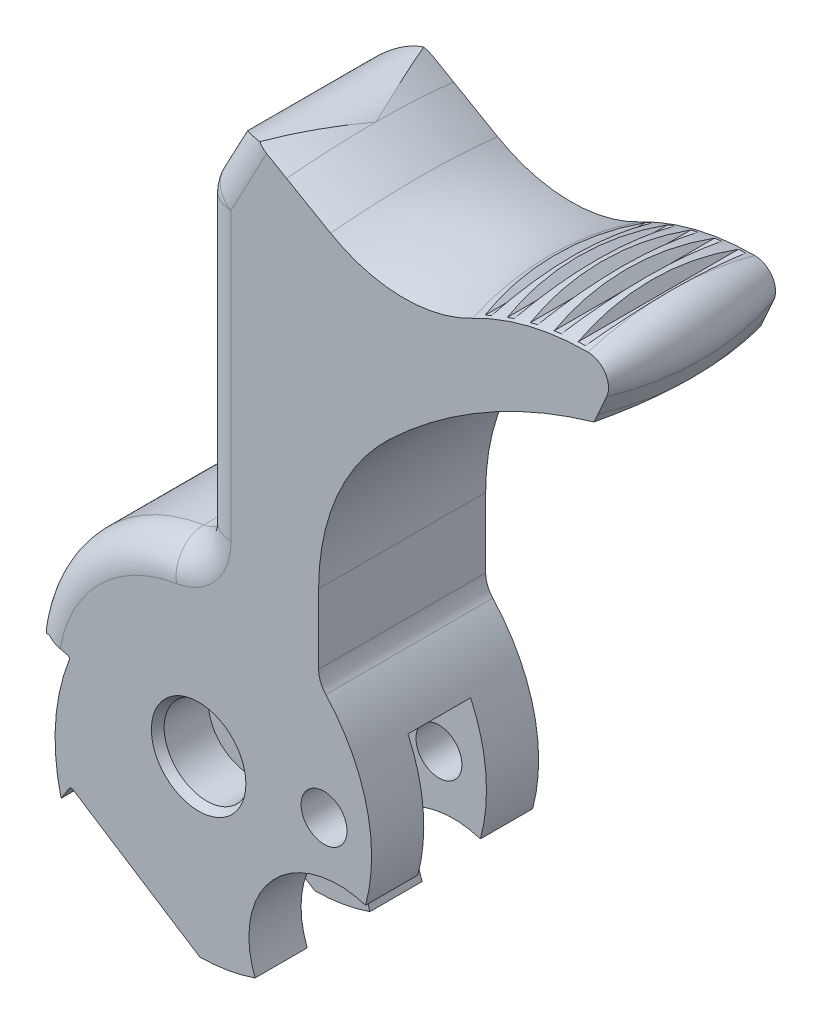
ISO-10303-21;
HEADER;
FILE_DESCRIPTION(('STEP AP214'),'2;1');
FILE_NAME('part.step','',(''),(''),'','','');
FILE_SCHEMA(('AUTOMOTIVE_DESIGN { 1 0 10303 214 1 1 1 1 }'));
ENDSEC;
DATA;
#1=APPLICATION_CONTEXT('core data for automotive mechanical design processes');
#2=APPLICATION_PROTOCOL_DEFINITION('international standard','automotive_design',2000,#1);
#3=PRODUCT_CONTEXT('',#1,'mechanical');
#4=PRODUCT('Part','Part','',(#3));
#5=PRODUCT_RELATED_PRODUCT_CATEGORY('part','',(#4));
#6=PRODUCT_DEFINITION_FORMATION('','',#4);
#7=PRODUCT_DEFINITION_CONTEXT('part definition',#1,'design');
#8=PRODUCT_DEFINITION('design','',#6,#7);
#9=PRODUCT_DEFINITION_SHAPE('','',#8);
#10=(LENGTH_UNIT() NAMED_UNIT(*) SI_UNIT(.MILLI.,.METRE.));
#11=(NAMED_UNIT(*) PLANE_ANGLE_UNIT() SI_UNIT($,.RADIAN.));
#12=(NAMED_UNIT(*) SI_UNIT($,.STERADIAN.) SOLID_ANGLE_UNIT());
#13=UNCERTAINTY_MEASURE_WITH_UNIT(LENGTH_MEASURE(1.E-05),#10,'distance_accuracy_value','');
#14=(GEOMETRIC_REPRESENTATION_CONTEXT(3) GLOBAL_UNCERTAINTY_ASSIGNED_CONTEXT((#13)) GLOBAL_UNIT_ASSIGNED_CONTEXT((#10,
#11,#12)) REPRESENTATION_CONTEXT('',''));
#15=CARTESIAN_POINT('',(0.,0.,0.));
#16=DIRECTION('',(0.,0.,1.));
#17=DIRECTION('',(1.,0.,0.));
#18=AXIS2_PLACEMENT_3D('',#15,#16,#17);
#19=CARTESIAN_POINT('',(0.,0.,3.9243));
#20=DIRECTION('',(0.,0.,-1.));
#21=DIRECTION('',(-1.,0.,0.));
#22=AXIS2_PLACEMENT_3D('',#19,#20,#21);
#23=CYLINDRICAL_SURFACE('',#22,2.00025);
#24=CARTESIAN_POINT('',(0.,0.,1.4732));
#25=DIRECTION('',(0.,0.,1.));
#26=DIRECTION('',(1.,0.,0.));
#27=AXIS2_PLACEMENT_3D('',#24,#25,#26);
#28=CIRCLE('',#27,2.00025);
#29=CARTESIAN_POINT('',(2.00025,0.,1.4732));
#30=VERTEX_POINT('',#29);
#31=EDGE_CURVE('E796',#30,#30,#28,.T.);
#32=ORIENTED_EDGE('',*,*,#31,.F.);
#33=EDGE_LOOP('',(#32));
#34=FACE_BOUND('',#33,.T.);
#35=CARTESIAN_POINT('',(0.,0.,3.5433));
#36=DIRECTION('',(0.,0.,1.));
#37=DIRECTION('',(1.,0.,0.));
#38=AXIS2_PLACEMENT_3D('',#35,#36,#37);
#39=CIRCLE('',#38,2.00025);
#40=CARTESIAN_POINT('',(2.00025,0.,3.5433));
#41=VERTEX_POINT('',#40);
#42=EDGE_CURVE('E1721',#41,#41,#39,.T.);
#43=ORIENTED_EDGE('',*,*,#42,.T.);
#44=EDGE_LOOP('',(#43));
#45=FACE_BOUND('',#44,.T.);
#46=ADVANCED_FACE('F34',(#34,#45),#23,.F.);
#47=CARTESIAN_POINT('',(0.,0.,-1.4732));
#48=DIRECTION('',(0.,0.,1.));
#49=DIRECTION('',(1.,0.,0.));
#50=AXIS2_PLACEMENT_3D('',#47,#48,#49);
#51=CIRCLE('',#50,2.00025);
#52=CARTESIAN_POINT('',(2.00025,0.,-1.4732));
#53=VERTEX_POINT('',#52);
#54=EDGE_CURVE('E792',#53,#53,#51,.T.);
#55=ORIENTED_EDGE('',*,*,#54,.T.);
#56=EDGE_LOOP('',(#55));
#57=FACE_BOUND('',#56,.T.);
#58=CARTESIAN_POINT('',(0.,0.,-3.5433));
#59=DIRECTION('',(0.,0.,1.));
#60=DIRECTION('',(1.,0.,0.));
#61=AXIS2_PLACEMENT_3D('',#58,#59,#60);
#62=CIRCLE('',#61,2.00025);
#63=CARTESIAN_POINT('',(2.00025,0.,-3.5433));
#64=VERTEX_POINT('',#63);
#65=EDGE_CURVE('E401',#64,#64,#62,.T.);
#66=ORIENTED_EDGE('',*,*,#65,.F.);
#67=EDGE_LOOP('',(#66));
#68=FACE_BOUND('',#67,.T.);
#69=ADVANCED_FACE('F896',(#57,#68),#23,.F.);
#70=CARTESIAN_POINT('',(-6.20004842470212,0.936099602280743,3.9243));
#71=DIRECTION('',(0.,0.,-1.));
#72=DIRECTION('',(-1.,0.,0.));
#73=AXIS2_PLACEMENT_3D('',#70,#71,#72);
#74=CYLINDRICAL_SURFACE('',#73,0.126999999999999);
#75=CARTESIAN_POINT('',(-6.20004842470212,0.936099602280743,-1.4732));
#76=DIRECTION('',(0.,0.,1.));
#77=DIRECTION('',(1.,0.,0.));
#78=AXIS2_PLACEMENT_3D('',#75,#76,#77);
#79=CIRCLE('',#78,0.126999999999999);
#80=CARTESIAN_POINT('',(-6.09946631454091,1.01363823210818,-1.4732));
#81=VERTEX_POINT('',#80);
#82=CARTESIAN_POINT('',(-6.08186183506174,0.889613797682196,-1.4732));
#83=VERTEX_POINT('',#82);
#84=EDGE_CURVE('E406',#81,#83,#79,.F.);
#85=ORIENTED_EDGE('',*,*,#84,.F.);
#86=DIRECTION('',(0.,0.,-1.));
#87=VECTOR('',#86,1.);
#88=CARTESIAN_POINT('',(-6.09946631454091,1.01363823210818,3.9243));
#89=LINE('',#88,#87);
#90=CARTESIAN_POINT('',(-6.09946631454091,1.01363823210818,1.4732));
#91=VERTEX_POINT('',#90);
#92=EDGE_CURVE('E395',#81,#91,#89,.F.);
#93=ORIENTED_EDGE('',*,*,#92,.T.);
#94=CARTESIAN_POINT('',(-6.20004842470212,0.936099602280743,1.4732));
#95=DIRECTION('',(0.,0.,1.));
#96=DIRECTION('',(1.,0.,0.));
#97=AXIS2_PLACEMENT_3D('',#94,#95,#96);
#98=CIRCLE('',#97,0.126999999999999);
#99=CARTESIAN_POINT('',(-6.08186183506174,0.889613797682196,1.4732));
#100=VERTEX_POINT('',#99);
#101=EDGE_CURVE('E379',#91,#100,#98,.F.);
#102=ORIENTED_EDGE('',*,*,#101,.T.);
#103=DIRECTION('',(0.,0.,-1.));
#104=VECTOR('',#103,1.);
#105=CARTESIAN_POINT('',(-6.08186183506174,0.889613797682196,3.9243));
#106=LINE('',#105,#104);
#107=CARTESIAN_POINT('',(-6.08186183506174,0.889613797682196,3.9243));
#108=VERTEX_POINT('',#107);
#109=EDGE_CURVE('E610',#108,#100,#106,.T.);
#110=ORIENTED_EDGE('',*,*,#109,.F.);
#111=CARTESIAN_POINT('',(-6.20004842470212,0.936099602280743,3.9243));
#112=DIRECTION('',(0.,0.,-1.));
#113=DIRECTION('',(1.,0.,0.));
#114=AXIS2_PLACEMENT_3D('',#111,#112,#113);
#115=CIRCLE('',#114,0.126999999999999);
#116=CARTESIAN_POINT('',(-6.17147964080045,1.05984460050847,3.9243));
#117=VERTEX_POINT('',#116);
#118=EDGE_CURVE('E509',#117,#108,#115,.T.);
#119=ORIENTED_EDGE('',*,*,#118,.F.);
#120=DIRECTION('',(0.,0.,-1.));
#121=VECTOR('',#120,1.);
#122=CARTESIAN_POINT('',(-6.17147964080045,1.05984460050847,3.9243));
#123=LINE('',#122,#121);
#124=CARTESIAN_POINT('',(-6.17147964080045,1.05984460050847,-3.9243));
#125=VERTEX_POINT('',#124);
#126=EDGE_CURVE('E612',#117,#125,#123,.T.);
#127=ORIENTED_EDGE('',*,*,#126,.T.);
#128=CARTESIAN_POINT('',(-6.20004842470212,0.936099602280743,-3.9243));
#129=DIRECTION('',(0.,0.,-1.));
#130=DIRECTION('',(1.,0.,0.));
#131=AXIS2_PLACEMENT_3D('',#128,#129,#130);
#132=CIRCLE('',#131,0.126999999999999);
#133=CARTESIAN_POINT('',(-6.08186183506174,0.889613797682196,-3.9243));
#134=VERTEX_POINT('',#133);
#135=EDGE_CURVE('E537',#125,#134,#132,.T.);
#136=ORIENTED_EDGE('',*,*,#135,.T.);
#137=EDGE_CURVE('E609',#83,#134,#106,.T.);
#138=ORIENTED_EDGE('',*,*,#137,.F.);
#139=EDGE_LOOP('',(#85,#93,#102,#110,#119,#127,#136,#138));
#140=FACE_BOUND('',#139,.T.);
#141=ADVANCED_FACE('F404',(#140),#74,.F.);
#142=CARTESIAN_POINT('',(2.82940702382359,-2.61541586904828,3.9243));
#143=DIRECTION('',(0.,0.,-1.));
#144=DIRECTION('',(-1.,0.,0.));
#145=AXIS2_PLACEMENT_3D('',#142,#143,#144);
#146=CYLINDRICAL_SURFACE('',#145,9.5758);
#147=CARTESIAN_POINT('',(2.82940702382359,-2.61541586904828,-1.4732));
#148=DIRECTION('',(0.,0.,1.));
#149=DIRECTION('',(1.,0.,0.));
#150=AXIS2_PLACEMENT_3D('',#147,#148,#149);
#151=CIRCLE('',#150,9.5758);
#152=CARTESIAN_POINT('',(-6.46259474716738,-4.9294272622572,-1.4732));
#153=VERTEX_POINT('',#152);
#154=EDGE_CURVE('E412',#83,#153,#151,.T.);
#155=ORIENTED_EDGE('',*,*,#154,.F.);
#156=ORIENTED_EDGE('',*,*,#137,.T.);
#157=CARTESIAN_POINT('',(2.82940702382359,-2.61541586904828,-3.9243));
#158=DIRECTION('',(0.,0.,1.));
#159=DIRECTION('',(1.,0.,0.));
#160=AXIS2_PLACEMENT_3D('',#157,#158,#159);
#161=CIRCLE('',#160,9.5758);
#162=CARTESIAN_POINT('',(-6.46259474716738,-4.9294272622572,-3.9243));
#163=VERTEX_POINT('',#162);
#164=EDGE_CURVE('E540',#134,#163,#161,.T.);
#165=ORIENTED_EDGE('',*,*,#164,.T.);
#166=DIRECTION('',(0.,0.,-1.));
#167=VECTOR('',#166,1.);
#168=CARTESIAN_POINT('',(-6.46259474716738,-4.9294272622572,3.9243));
#169=LINE('',#168,#167);
#170=EDGE_CURVE('E605',#153,#163,#169,.T.);
#171=ORIENTED_EDGE('',*,*,#170,.F.);
#172=EDGE_LOOP('',(#155,#156,#165,#171));
#173=FACE_BOUND('',#172,.T.);
#174=ADVANCED_FACE('F1440',(#173),#146,.T.);
#175=CARTESIAN_POINT('',(-6.07972579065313,-4.33419080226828,3.9243));
#176=DIRECTION('',(-0.841039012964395,0.54097447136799,0.));
#177=DIRECTION('',(-0.54097447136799,-0.841039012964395,0.));
#178=AXIS2_PLACEMENT_3D('',#175,#176,#177);
#179=PLANE('',#178);
#180=DIRECTION('',(0.54097447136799,0.841039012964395,0.));
#181=VECTOR('',#180,1.);
#182=CARTESIAN_POINT('',(-6.07972579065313,-4.33419080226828,-1.4732));
#183=LINE('',#182,#181);
#184=CARTESIAN_POINT('',(-6.07972579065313,-4.33419080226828,-1.4732));
#185=VERTEX_POINT('',#184);
#186=EDGE_CURVE('E1688',#153,#185,#183,.T.);
#187=ORIENTED_EDGE('',*,*,#186,.F.);
#188=ORIENTED_EDGE('',*,*,#170,.T.);
#189=DIRECTION('',(0.54097447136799,0.841039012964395,0.));
#190=VECTOR('',#189,1.);
#191=CARTESIAN_POINT('',(-6.07972579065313,-4.33419080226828,-3.9243));
#192=LINE('',#191,#190);
#193=CARTESIAN_POINT('',(-6.07972579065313,-4.33419080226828,-3.9243));
#194=VERTEX_POINT('',#193);
#195=EDGE_CURVE('E543',#163,#194,#192,.T.);
#196=ORIENTED_EDGE('',*,*,#195,.T.);
#197=DIRECTION('',(0.,0.,-1.));
#198=VECTOR('',#197,1.);
#199=CARTESIAN_POINT('',(-6.07972579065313,-4.33419080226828,3.9243));
#200=LINE('',#199,#198);
#201=EDGE_CURVE('E601',#185,#194,#200,.T.);
#202=ORIENTED_EDGE('',*,*,#201,.F.);
#203=EDGE_LOOP('',(#187,#188,#196,#202));
#204=FACE_BOUND('',#203,.T.);
#205=ADVANCED_FACE('F1435',(#204),#179,.F.);
#206=CARTESIAN_POINT('',(-5.97291383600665,-4.40289456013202,3.9243));
#207=DIRECTION('',(0.,0.,-1.));
#208=DIRECTION('',(-1.,0.,0.));
#209=AXIS2_PLACEMENT_3D('',#206,#207,#208);
#210=CYLINDRICAL_SURFACE('',#209,0.127);
#211=CARTESIAN_POINT('',(-5.97291383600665,-4.40289456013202,-1.4732));
#212=DIRECTION('',(0.,0.,1.));
#213=DIRECTION('',(1.,0.,0.));
#214=AXIS2_PLACEMENT_3D('',#211,#212,#213);
#215=CIRCLE('',#214,0.127);
#216=CARTESIAN_POINT('',(-5.90421007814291,-4.29608260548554,-1.4732));
#217=VERTEX_POINT('',#216);
#218=EDGE_CURVE('E1689',#185,#217,#215,.F.);
#219=ORIENTED_EDGE('',*,*,#218,.F.);
#220=ORIENTED_EDGE('',*,*,#201,.T.);
#221=CARTESIAN_POINT('',(-5.97291383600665,-4.40289456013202,-3.9243));
#222=DIRECTION('',(0.,0.,-1.));
#223=DIRECTION('',(-1.,0.,0.));
#224=AXIS2_PLACEMENT_3D('',#221,#222,#223);
#225=CIRCLE('',#224,0.127);
#226=CARTESIAN_POINT('',(-5.90421007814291,-4.29608260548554,-3.9243));
#227=VERTEX_POINT('',#226);
#228=EDGE_CURVE('E546',#194,#227,#225,.T.);
#229=ORIENTED_EDGE('',*,*,#228,.T.);
#230=DIRECTION('',(0.,0.,-1.));
#231=VECTOR('',#230,1.);
#232=CARTESIAN_POINT('',(-5.90421007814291,-4.29608260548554,3.9243));
#233=LINE('',#232,#231);
#234=EDGE_CURVE('E597',#217,#227,#233,.T.);
#235=ORIENTED_EDGE('',*,*,#234,.F.);
#236=EDGE_LOOP('',(#219,#220,#229,#235));
#237=FACE_BOUND('',#236,.T.);
#238=ADVANCED_FACE('F1429',(#237),#210,.F.);
#239=CARTESIAN_POINT('',(0.0529050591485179,-8.12782781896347,3.9243));
#240=DIRECTION('',(0.540974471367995,0.841039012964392,0.));
#241=DIRECTION('',(-0.841039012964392,0.540974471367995,0.));
#242=AXIS2_PLACEMENT_3D('',#239,#240,#241);
#243=PLANE('',#242);
#244=DIRECTION('',(0.841039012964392,-0.540974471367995,0.));
#245=VECTOR('',#244,1.);
#246=CARTESIAN_POINT('',(0.0529050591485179,-8.12782781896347,-1.4732));
#247=LINE('',#246,#245);
#248=CARTESIAN_POINT('',(0.0529050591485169,-8.12782781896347,-1.4732));
#249=VERTEX_POINT('',#248);
#250=EDGE_CURVE('E1693',#217,#249,#247,.T.);
#251=ORIENTED_EDGE('',*,*,#250,.F.);
#252=ORIENTED_EDGE('',*,*,#234,.T.);
#253=DIRECTION('',(0.841039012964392,-0.540974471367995,0.));
#254=VECTOR('',#253,1.);
#255=CARTESIAN_POINT('',(0.0529050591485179,-8.12782781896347,-3.9243));
#256=LINE('',#255,#254);
#257=CARTESIAN_POINT('',(0.0529050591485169,-8.12782781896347,-3.9243));
#258=VERTEX_POINT('',#257);
#259=EDGE_CURVE('E549',#227,#258,#256,.T.);
#260=ORIENTED_EDGE('',*,*,#259,.T.);
#261=DIRECTION('',(0.,0.,-1.));
#262=VECTOR('',#261,1.);
#263=CARTESIAN_POINT('',(0.0529050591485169,-8.12782781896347,3.9243));
#264=LINE('',#263,#262);
#265=EDGE_CURVE('E593',#249,#258,#264,.T.);
#266=ORIENTED_EDGE('',*,*,#265,.F.);
#267=EDGE_LOOP('',(#251,#252,#260,#266));
#268=FACE_BOUND('',#267,.T.);
#269=ADVANCED_FACE('F1422',(#268),#243,.F.);
#270=CARTESIAN_POINT('',(0.,0.,3.9243));
#271=DIRECTION('',(0.,0.,-1.));
#272=DIRECTION('',(-1.,0.,0.));
#273=AXIS2_PLACEMENT_3D('',#270,#271,#272);
#274=CYLINDRICAL_SURFACE('',#273,8.128);
#275=CARTESIAN_POINT('',(0.,0.,-1.4732));
#276=DIRECTION('',(0.,0.,1.));
#277=DIRECTION('',(1.,0.,0.));
#278=AXIS2_PLACEMENT_3D('',#275,#276,#277);
#279=CIRCLE('',#278,8.128);
#280=CARTESIAN_POINT('',(2.65207035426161,-7.68315734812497,-1.4732));
#281=VERTEX_POINT('',#280);
#282=EDGE_CURVE('E1695',#249,#281,#279,.T.);
#283=ORIENTED_EDGE('',*,*,#282,.F.);
#284=ORIENTED_EDGE('',*,*,#265,.T.);
#285=CARTESIAN_POINT('',(0.,0.,-3.9243));
#286=DIRECTION('',(0.,0.,1.));
#287=DIRECTION('',(1.,0.,0.));
#288=AXIS2_PLACEMENT_3D('',#285,#286,#287);
#289=CIRCLE('',#288,8.128);
#290=CARTESIAN_POINT('',(2.65207035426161,-7.68315734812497,-3.9243));
#291=VERTEX_POINT('',#290);
#292=EDGE_CURVE('E552',#258,#291,#289,.T.);
#293=ORIENTED_EDGE('',*,*,#292,.T.);
#294=DIRECTION('',(0.,0.,-1.));
#295=VECTOR('',#294,1.);
#296=CARTESIAN_POINT('',(2.65207035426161,-7.68315734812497,3.9243));
#297=LINE('',#296,#295);
#298=EDGE_CURVE('E589',#281,#291,#297,.T.);
#299=ORIENTED_EDGE('',*,*,#298,.F.);
#300=EDGE_LOOP('',(#283,#284,#293,#299));
#301=FACE_BOUND('',#300,.T.);
#302=ADVANCED_FACE('F1415',(#301),#274,.T.);
#303=CARTESIAN_POINT('',(6.5786,-6.1468,3.9243));
#304=DIRECTION('',(0.,0.,-1.));
#305=DIRECTION('',(-1.,0.,0.));
#306=AXIS2_PLACEMENT_3D('',#303,#304,#305);
#307=CYLINDRICAL_SURFACE('',#306,4.2164);
#308=CARTESIAN_POINT('',(6.5786,-6.1468,-1.4732));
#309=DIRECTION('',(0.,0.,1.));
#310=DIRECTION('',(1.,0.,0.));
#311=AXIS2_PLACEMENT_3D('',#308,#309,#310);
#312=CIRCLE('',#311,4.2164);
#313=CARTESIAN_POINT('',(7.84525890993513,-2.12515802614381,-1.4732));
#314=VERTEX_POINT('',#313);
#315=EDGE_CURVE('E1697',#281,#314,#312,.F.);
#316=ORIENTED_EDGE('',*,*,#315,.F.);
#317=ORIENTED_EDGE('',*,*,#298,.T.);
#318=CARTESIAN_POINT('',(6.5786,-6.1468,-3.9243));
#319=DIRECTION('',(0.,0.,-1.));
#320=DIRECTION('',(-1.,0.,0.));
#321=AXIS2_PLACEMENT_3D('',#318,#319,#320);
#322=CIRCLE('',#321,4.2164);
#323=CARTESIAN_POINT('',(7.84525890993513,-2.12515802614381,-3.9243));
#324=VERTEX_POINT('',#323);
#325=EDGE_CURVE('E555',#291,#324,#322,.T.);
#326=ORIENTED_EDGE('',*,*,#325,.T.);
#327=DIRECTION('',(0.,0.,-1.));
#328=VECTOR('',#327,1.);
#329=CARTESIAN_POINT('',(7.84525890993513,-2.12515802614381,3.9243));
#330=LINE('',#329,#328);
#331=EDGE_CURVE('E585',#314,#324,#330,.T.);
#332=ORIENTED_EDGE('',*,*,#331,.F.);
#333=EDGE_LOOP('',(#316,#317,#326,#332));
#334=FACE_BOUND('',#333,.T.);
#335=ADVANCED_FACE('F1411',(#334),#307,.F.);
#336=CARTESIAN_POINT('',(0.,0.,3.9243));
#337=DIRECTION('',(0.,0.,-1.));
#338=DIRECTION('',(-1.,0.,0.));
#339=AXIS2_PLACEMENT_3D('',#336,#337,#338);
#340=CYLINDRICAL_SURFACE('',#339,8.128);
#341=CARTESIAN_POINT('',(0.,0.,-1.4732));
#342=DIRECTION('',(0.,0.,1.));
#343=DIRECTION('',(1.,0.,0.));
#344=AXIS2_PLACEMENT_3D('',#341,#342,#343);
#345=CIRCLE('',#344,8.128);
#346=CARTESIAN_POINT('',(7.38657519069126,3.39159121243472,-1.4732));
#347=VERTEX_POINT('',#346);
#348=EDGE_CURVE('E1699',#314,#347,#345,.T.);
#349=ORIENTED_EDGE('',*,*,#348,.F.);
#350=ORIENTED_EDGE('',*,*,#331,.T.);
#351=CARTESIAN_POINT('',(0.,0.,-3.9243));
#352=DIRECTION('',(0.,0.,1.));
#353=DIRECTION('',(1.,0.,0.));
#354=AXIS2_PLACEMENT_3D('',#351,#352,#353);
#355=CIRCLE('',#354,8.128);
#356=CARTESIAN_POINT('',(5.97517837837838,5.51013859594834,-3.9243));
#357=VERTEX_POINT('',#356);
#358=EDGE_CURVE('E558',#324,#357,#355,.T.);
#359=ORIENTED_EDGE('',*,*,#358,.T.);
#360=DIRECTION('',(0.,0.,-1.));
#361=VECTOR('',#360,1.);
#362=CARTESIAN_POINT('',(5.97517837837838,5.51013859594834,3.9243));
#363=LINE('',#362,#361);
#364=CARTESIAN_POINT('',(5.97517837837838,5.51013859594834,3.9243));
#365=VERTEX_POINT('',#364);
#366=EDGE_CURVE('E582',#365,#357,#363,.T.);
#367=ORIENTED_EDGE('',*,*,#366,.F.);
#368=CARTESIAN_POINT('',(0.,0.,3.9243));
#369=DIRECTION('',(0.,0.,1.));
#370=DIRECTION('',(1.,0.,0.));
#371=AXIS2_PLACEMENT_3D('',#368,#369,#370);
#372=CIRCLE('',#371,8.128);
#373=CARTESIAN_POINT('',(7.84525890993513,-2.12515802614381,3.9243));
#374=VERTEX_POINT('',#373);
#375=EDGE_CURVE('E524',#374,#365,#372,.T.);
#376=ORIENTED_EDGE('',*,*,#375,.F.);
#377=CARTESIAN_POINT('',(7.84525890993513,-2.12515802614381,1.4732));
#378=VERTEX_POINT('',#377);
#379=EDGE_CURVE('E586',#374,#378,#330,.T.);
#380=ORIENTED_EDGE('',*,*,#379,.T.);
#381=CARTESIAN_POINT('',(0.,0.,1.4732));
#382=DIRECTION('',(0.,0.,1.));
#383=DIRECTION('',(1.,0.,0.));
#384=AXIS2_PLACEMENT_3D('',#381,#382,#383);
#385=CIRCLE('',#384,8.128);
#386=CARTESIAN_POINT('',(7.38657519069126,3.39159121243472,1.4732));
#387=VERTEX_POINT('',#386);
#388=EDGE_CURVE('E1711',#378,#387,#385,.T.);
#389=ORIENTED_EDGE('',*,*,#388,.T.);
#390=DIRECTION('',(0.,0.,-1.));
#391=VECTOR('',#390,1.);
#392=CARTESIAN_POINT('',(7.38657519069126,3.39159121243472,3.9243));
#393=LINE('',#392,#391);
#394=EDGE_CURVE('E398',#387,#347,#393,.T.);
#395=ORIENTED_EDGE('',*,*,#394,.T.);
#396=EDGE_LOOP('',(#349,#350,#359,#367,#376,#380,#389,#395));
#397=FACE_BOUND('',#396,.T.);
#398=ADVANCED_FACE('F1231',(#397),#340,.T.);
#399=CARTESIAN_POINT('',(5.8928,0.4572,3.9243));
#400=DIRECTION('',(0.,0.,-1.));
#401=DIRECTION('',(-1.,0.,0.));
#402=AXIS2_PLACEMENT_3D('',#399,#400,#401);
#403=CYLINDRICAL_SURFACE('',#402,1.0795);
#404=CARTESIAN_POINT('',(5.8928,0.4572,-3.9243));
#405=DIRECTION('',(0.,0.,1.));
#406=DIRECTION('',(1.,0.,0.));
#407=AXIS2_PLACEMENT_3D('',#404,#405,#406);
#408=CIRCLE('',#407,1.0795);
#409=CARTESIAN_POINT('',(6.9723,0.4572,-3.9243));
#410=VERTEX_POINT('',#409);
#411=EDGE_CURVE('E500',#410,#410,#408,.T.);
#412=ORIENTED_EDGE('',*,*,#411,.F.);
#413=EDGE_LOOP('',(#412));
#414=FACE_BOUND('',#413,.T.);
#415=CARTESIAN_POINT('',(5.8928,0.4572,-1.4732));
#416=DIRECTION('',(0.,0.,1.));
#417=DIRECTION('',(1.,0.,0.));
#418=AXIS2_PLACEMENT_3D('',#415,#416,#417);
#419=CIRCLE('',#418,1.0795);
#420=CARTESIAN_POINT('',(6.9723,0.4572,-1.4732));
#421=VERTEX_POINT('',#420);
#422=EDGE_CURVE('E390',#421,#421,#419,.T.);
#423=ORIENTED_EDGE('',*,*,#422,.T.);
#424=EDGE_LOOP('',(#423));
#425=FACE_BOUND('',#424,.T.);
#426=ADVANCED_FACE('F912',(#414,#425),#403,.F.);
#427=CARTESIAN_POINT('',(-1.524,9.53092482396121,3.9243));
#428=DIRECTION('',(0.,0.,-1.));
#429=DIRECTION('',(-1.,0.,0.));
#430=AXIS2_PLACEMENT_3D('',#427,#428,#429);
#431=PLANE('',#430);
#432=DIRECTION('',(-0.866025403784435,0.500000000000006,0.));
#433=VECTOR('',#432,1.);
#434=CARTESIAN_POINT('',(4.13588319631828,25.5930088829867,3.9243));
#435=LINE('',#434,#433);
#436=CARTESIAN_POINT('',(4.13588319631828,25.5930088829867,3.9243));
#437=VERTEX_POINT('',#436);
#438=CARTESIAN_POINT('',(3.1953451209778,26.1360287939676,3.9243));
#439=VERTEX_POINT('',#438);
#440=EDGE_CURVE('E466',#437,#439,#435,.T.);
#441=ORIENTED_EDGE('',*,*,#440,.T.);
#442=DIRECTION('',(-0.469471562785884,-0.882947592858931,0.));
#443=VECTOR('',#442,1.);
#444=CARTESIAN_POINT('',(-4.72794283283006,11.2344914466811,3.9243));
#445=LINE('',#444,#443);
#446=CARTESIAN_POINT('',(1.524,22.9926857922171,3.9243));
#447=VERTEX_POINT('',#446);
#448=EDGE_CURVE('E774',#439,#447,#445,.T.);
#449=ORIENTED_EDGE('',*,*,#448,.T.);
#450=DIRECTION('',(0.,-1.,0.));
#451=VECTOR('',#450,1.);
#452=CARTESIAN_POINT('',(1.524,9.53092482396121,3.9243));
#453=LINE('',#452,#451);
#454=CARTESIAN_POINT('',(1.524,9.53092482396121,3.9243));
#455=VERTEX_POINT('',#454);
#456=EDGE_CURVE('E782',#447,#455,#453,.T.);
#457=ORIENTED_EDGE('',*,*,#456,.T.);
#458=CARTESIAN_POINT('',(-1.524,9.53092482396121,3.9243));
#459=DIRECTION('',(0.,0.,-1.));
#460=DIRECTION('',(-1.,0.,0.));
#461=AXIS2_PLACEMENT_3D('',#458,#459,#460);
#462=CIRCLE('',#461,3.048);
#463=CARTESIAN_POINT('',(-1.04273684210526,6.52115909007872,3.9243));
#464=VERTEX_POINT('',#463);
#465=EDGE_CURVE('E780',#455,#464,#462,.T.);
#466=ORIENTED_EDGE('',*,*,#465,.T.);
#467=CARTESIAN_POINT('',(0.,0.,3.9243));
#468=DIRECTION('',(0.,0.,-1.));
#469=DIRECTION('',(-1.,0.,0.));
#470=AXIS2_PLACEMENT_3D('',#467,#468,#469);
#471=CIRCLE('',#470,6.604);
#472=CARTESIAN_POINT('',(-6.50539726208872,1.13693555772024,3.9243));
#473=VERTEX_POINT('',#472);
#474=EDGE_CURVE('E776',#464,#473,#471,.F.);
#475=ORIENTED_EDGE('',*,*,#474,.T.);
#476=DIRECTION('',(0.974370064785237,-0.224951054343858,0.));
#477=VECTOR('',#476,1.);
#478=CARTESIAN_POINT('',(-6.17147964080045,1.05984460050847,3.9243));
#479=LINE('',#478,#477);
#480=EDGE_CURVE('E507',#473,#117,#479,.T.);
#481=ORIENTED_EDGE('',*,*,#480,.T.);
#482=ORIENTED_EDGE('',*,*,#118,.T.);
#483=CARTESIAN_POINT('',(2.82940702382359,-2.61541586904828,3.9243));
#484=DIRECTION('',(0.,0.,1.));
#485=DIRECTION('',(1.,0.,0.));
#486=AXIS2_PLACEMENT_3D('',#483,#484,#485);
#487=CIRCLE('',#486,9.5758);
#488=CARTESIAN_POINT('',(-6.46259474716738,-4.9294272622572,3.9243));
#489=VERTEX_POINT('',#488);
#490=EDGE_CURVE('E512',#108,#489,#487,.T.);
#491=ORIENTED_EDGE('',*,*,#490,.T.);
#492=DIRECTION('',(0.54097447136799,0.841039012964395,0.));
#493=VECTOR('',#492,1.);
#494=CARTESIAN_POINT('',(-6.07972579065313,-4.33419080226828,3.9243));
#495=LINE('',#494,#493);
#496=CARTESIAN_POINT('',(-6.07972579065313,-4.33419080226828,3.9243));
#497=VERTEX_POINT('',#496);
#498=EDGE_CURVE('E514',#489,#497,#495,.T.);
#499=ORIENTED_EDGE('',*,*,#498,.T.);
#500=CARTESIAN_POINT('',(-5.97291383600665,-4.40289456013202,3.9243));
#501=DIRECTION('',(0.,0.,-1.));
#502=DIRECTION('',(-1.,0.,0.));
#503=AXIS2_PLACEMENT_3D('',#500,#501,#502);
#504=CIRCLE('',#503,0.127);
#505=CARTESIAN_POINT('',(-5.90421007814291,-4.29608260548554,3.9243));
#506=VERTEX_POINT('',#505);
#507=EDGE_CURVE('E516',#497,#506,#504,.T.);
#508=ORIENTED_EDGE('',*,*,#507,.T.);
#509=DIRECTION('',(0.841039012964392,-0.540974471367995,0.));
#510=VECTOR('',#509,1.);
#511=CARTESIAN_POINT('',(0.0529050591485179,-8.12782781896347,3.9243));
#512=LINE('',#511,#510);
#513=CARTESIAN_POINT('',(0.0529050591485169,-8.12782781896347,3.9243));
#514=VERTEX_POINT('',#513);
#515=EDGE_CURVE('E518',#506,#514,#512,.T.);
#516=ORIENTED_EDGE('',*,*,#515,.T.);
#517=CARTESIAN_POINT('',(0.,0.,3.9243));
#518=DIRECTION('',(0.,0.,1.));
#519=DIRECTION('',(1.,0.,0.));
#520=AXIS2_PLACEMENT_3D('',#517,#518,#519);
#521=CIRCLE('',#520,8.128);
#522=CARTESIAN_POINT('',(2.65207035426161,-7.68315734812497,3.9243));
#523=VERTEX_POINT('',#522);
#524=EDGE_CURVE('E520',#514,#523,#521,.T.);
#525=ORIENTED_EDGE('',*,*,#524,.T.);
#526=CARTESIAN_POINT('',(6.5786,-6.1468,3.9243));
#527=DIRECTION('',(0.,0.,-1.));
#528=DIRECTION('',(-1.,0.,0.));
#529=AXIS2_PLACEMENT_3D('',#526,#527,#528);
#530=CIRCLE('',#529,4.2164);
#531=EDGE_CURVE('E522',#523,#374,#530,.T.);
#532=ORIENTED_EDGE('',*,*,#531,.T.);
#533=ORIENTED_EDGE('',*,*,#375,.T.);
#534=CARTESIAN_POINT('',(6.9088,6.37109775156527,3.9243));
#535=DIRECTION('',(0.,0.,-1.));
#536=DIRECTION('',(1.,0.,0.));
#537=AXIS2_PLACEMENT_3D('',#534,#535,#536);
#538=CIRCLE('',#537,1.27);
#539=CARTESIAN_POINT('',(5.6388,6.37109775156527,3.9243));
#540=VERTEX_POINT('',#539);
#541=EDGE_CURVE('E526',#365,#540,#538,.T.);
#542=ORIENTED_EDGE('',*,*,#541,.T.);
#543=DIRECTION('',(0.,1.,0.));
#544=VECTOR('',#543,1.);
#545=CARTESIAN_POINT('',(5.6388,9.652,3.9243));
#546=LINE('',#545,#544);
#547=CARTESIAN_POINT('',(5.6388,9.652,3.9243));
#548=VERTEX_POINT('',#547);
#549=EDGE_CURVE('E528',#540,#548,#546,.T.);
#550=ORIENTED_EDGE('',*,*,#549,.T.);
#551=CARTESIAN_POINT('',(16.3068,9.652,3.9243));
#552=DIRECTION('',(0.,0.,-1.));
#553=DIRECTION('',(1.,0.,0.));
#554=AXIS2_PLACEMENT_3D('',#551,#552,#553);
#555=CIRCLE('',#554,10.668);
#556=CARTESIAN_POINT('',(8.94801390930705,17.375632,3.9243));
#557=VERTEX_POINT('',#556);
#558=EDGE_CURVE('E530',#548,#557,#555,.T.);
#559=ORIENTED_EDGE('',*,*,#558,.T.);
#560=CARTESIAN_POINT('',(25.0672596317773,0.4572,3.9243));
#561=DIRECTION('',(0.,0.,-1.));
#562=DIRECTION('',(1.,0.,0.));
#563=AXIS2_PLACEMENT_3D('',#560,#561,#562);
#564=CIRCLE('',#563,23.368);
#565=CARTESIAN_POINT('',(18.5812496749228,22.90703516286,3.9243));
#566=VERTEX_POINT('',#565);
#567=EDGE_CURVE('E532',#557,#566,#564,.T.);
#568=ORIENTED_EDGE('',*,*,#567,.T.);
#569=DIRECTION('',(-0.406736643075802,-0.9135454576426,0.));
#570=VECTOR('',#569,1.);
#571=CARTESIAN_POINT('',(18.7646471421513,23.3189526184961,3.9243));
#572=LINE('',#571,#570);
#573=CARTESIAN_POINT('',(18.7646471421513,23.318952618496,3.9243));
#574=VERTEX_POINT('',#573);
#575=EDGE_CURVE('E498',#574,#566,#572,.T.);
#576=ORIENTED_EDGE('',*,*,#575,.F.);
#577=DIRECTION('',(-0.406736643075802,-0.9135454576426,0.));
#578=VECTOR('',#577,1.);
#579=CARTESIAN_POINT('',(19.1759147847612,24.2426748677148,3.9243));
#580=LINE('',#579,#578);
#581=CARTESIAN_POINT('',(19.1759147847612,24.2426748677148,3.9243));
#582=VERTEX_POINT('',#581);
#583=EDGE_CURVE('E493',#582,#574,#580,.T.);
#584=ORIENTED_EDGE('',*,*,#583,.F.);
#585=CARTESIAN_POINT('',(18.288,24.638,3.9243));
#586=DIRECTION('',(0.,0.,-1.));
#587=DIRECTION('',(-1.,0.,0.));
#588=AXIS2_PLACEMENT_3D('',#585,#586,#587);
#589=CIRCLE('',#588,0.971943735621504);
#590=CARTESIAN_POINT('',(18.288,25.6099437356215,3.9243));
#591=VERTEX_POINT('',#590);
#592=EDGE_CURVE('E488',#591,#582,#589,.T.);
#593=ORIENTED_EDGE('',*,*,#592,.F.);
#594=CARTESIAN_POINT('',(18.288,13.97,3.9243));
#595=DIRECTION('',(0.,0.,-1.));
#596=DIRECTION('',(-1.,0.,0.));
#597=AXIS2_PLACEMENT_3D('',#594,#595,#596);
#598=CIRCLE('',#597,11.6399437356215);
#599=CARTESIAN_POINT('',(12.8666563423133,24.2703554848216,3.9243));
#600=VERTEX_POINT('',#599);
#601=EDGE_CURVE('E482',#600,#591,#598,.T.);
#602=ORIENTED_EDGE('',*,*,#601,.F.);
#603=CARTESIAN_POINT('',(9.652,30.3780854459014,3.9243));
#604=DIRECTION('',(0.,0.,1.));
#605=DIRECTION('',(1.,0.,0.));
#606=AXIS2_PLACEMENT_3D('',#603,#604,#605);
#607=CIRCLE('',#606,6.9020562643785);
#608=CARTESIAN_POINT('',(6.20097186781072,24.4007293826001,3.9243));
#609=VERTEX_POINT('',#608);
#610=EDGE_CURVE('E477',#609,#600,#607,.T.);
#611=ORIENTED_EDGE('',*,*,#610,.F.);
#612=DIRECTION('',(0.866025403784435,-0.500000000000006,0.));
#613=VECTOR('',#612,1.);
#614=CARTESIAN_POINT('',(4.13588319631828,25.5930088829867,3.9243));
#615=LINE('',#614,#613);
#616=EDGE_CURVE('E472',#437,#609,#615,.T.);
#617=ORIENTED_EDGE('',*,*,#616,.F.);
#618=EDGE_LOOP('',(#441,#449,#457,#466,#475,#481,#482,#491,#499,#508,#516,#525,#532,#533,#542,
#550,#559,#568,#576,#584,#593,#602,#611,#617));
#619=FACE_BOUND('',#618,.T.);
#620=CARTESIAN_POINT('',(0.,0.,3.9243));
#621=DIRECTION('',(0.,0.,1.));
#622=DIRECTION('',(1.,0.,0.));
#623=AXIS2_PLACEMENT_3D('',#620,#621,#622);
#624=CIRCLE('',#623,2.22022045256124);
#625=CARTESIAN_POINT('',(2.22022045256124,0.,3.9243));
#626=VERTEX_POINT('',#625);
#627=EDGE_CURVE('E711',#626,#626,#624,.T.);
#628=ORIENTED_EDGE('',*,*,#627,.F.);
#629=EDGE_LOOP('',(#628));
#630=FACE_BOUND('',#629,.T.);
#631=CARTESIAN_POINT('',(5.8928,0.4572,3.9243));
#632=DIRECTION('',(0.,0.,1.));
#633=DIRECTION('',(1.,0.,0.));
#634=AXIS2_PLACEMENT_3D('',#631,#632,#633);
#635=CIRCLE('',#634,1.0795);
#636=CARTESIAN_POINT('',(6.9723,0.4572,3.9243));
#637=VERTEX_POINT('',#636);
#638=EDGE_CURVE('E501',#637,#637,#635,.T.);
#639=ORIENTED_EDGE('',*,*,#638,.F.);
#640=EDGE_LOOP('',(#639));
#641=FACE_BOUND('',#640,.T.);
#642=ADVANCED_FACE('F909',(#619,#630,#641),#431,.F.);
#643=CARTESIAN_POINT('',(-1.524,9.53092482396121,-3.9243));
#644=DIRECTION('',(0.,0.,-1.));
#645=DIRECTION('',(-1.,0.,0.));
#646=AXIS2_PLACEMENT_3D('',#643,#644,#645);
#647=PLANE('',#646);
#648=CARTESIAN_POINT('',(0.,0.,-3.9243));
#649=DIRECTION('',(0.,0.,1.));
#650=DIRECTION('',(1.,0.,0.));
#651=AXIS2_PLACEMENT_3D('',#648,#649,#650);
#652=CIRCLE('',#651,2.22022045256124);
#653=CARTESIAN_POINT('',(2.22022045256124,0.,-3.9243));
#654=VERTEX_POINT('',#653);
#655=EDGE_CURVE('E1718',#654,#654,#652,.T.);
#656=ORIENTED_EDGE('',*,*,#655,.T.);
#657=EDGE_LOOP('',(#656));
#658=FACE_BOUND('',#657,.T.);
#659=ORIENTED_EDGE('',*,*,#411,.T.);
#660=EDGE_LOOP('',(#659));
#661=FACE_BOUND('',#660,.T.);
#662=DIRECTION('',(0.,-1.,0.));
#663=VECTOR('',#662,1.);
#664=CARTESIAN_POINT('',(1.524,22.9926857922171,-3.9243));
#665=LINE('',#664,#663);
#666=CARTESIAN_POINT('',(1.524,9.53092482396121,-3.9243));
#667=VERTEX_POINT('',#666);
#668=CARTESIAN_POINT('',(1.524,22.9926857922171,-3.9243));
#669=VERTEX_POINT('',#668);
#670=EDGE_CURVE('E58',#667,#669,#665,.F.);
#671=ORIENTED_EDGE('',*,*,#670,.T.);
#672=DIRECTION('',(-0.469471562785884,-0.882947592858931,0.));
#673=VECTOR('',#672,1.);
#674=CARTESIAN_POINT('',(2.24483657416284,24.3483822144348,-3.9243));
#675=LINE('',#674,#673);
#676=CARTESIAN_POINT('',(3.1953451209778,26.1360287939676,-3.9243));
#677=VERTEX_POINT('',#676);
#678=EDGE_CURVE('E697',#669,#677,#675,.F.);
#679=ORIENTED_EDGE('',*,*,#678,.T.);
#680=DIRECTION('',(-0.866025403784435,0.500000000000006,0.));
#681=VECTOR('',#680,1.);
#682=CARTESIAN_POINT('',(4.13588319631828,25.5930088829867,-3.9243));
#683=LINE('',#682,#681);
#684=CARTESIAN_POINT('',(4.13588319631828,25.5930088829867,-3.9243));
#685=VERTEX_POINT('',#684);
#686=EDGE_CURVE('E463',#685,#677,#683,.T.);
#687=ORIENTED_EDGE('',*,*,#686,.F.);
#688=DIRECTION('',(0.866025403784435,-0.500000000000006,0.));
#689=VECTOR('',#688,1.);
#690=CARTESIAN_POINT('',(4.13588319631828,25.5930088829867,-3.9243));
#691=LINE('',#690,#689);
#692=CARTESIAN_POINT('',(6.20097186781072,24.4007293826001,-3.9243));
#693=VERTEX_POINT('',#692);
#694=EDGE_CURVE('E469',#685,#693,#691,.T.);
#695=ORIENTED_EDGE('',*,*,#694,.T.);
#696=CARTESIAN_POINT('',(9.652,30.3780854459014,-3.9243));
#697=DIRECTION('',(0.,0.,1.));
#698=DIRECTION('',(1.,0.,0.));
#699=AXIS2_PLACEMENT_3D('',#696,#697,#698);
#700=CIRCLE('',#699,6.9020562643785);
#701=CARTESIAN_POINT('',(12.8666563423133,24.2703554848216,-3.9243));
#702=VERTEX_POINT('',#701);
#703=EDGE_CURVE('E474',#693,#702,#700,.T.);
#704=ORIENTED_EDGE('',*,*,#703,.T.);
#705=CARTESIAN_POINT('',(18.288,13.97,-3.9243));
#706=DIRECTION('',(0.,0.,-1.));
#707=DIRECTION('',(-1.,0.,0.));
#708=AXIS2_PLACEMENT_3D('',#705,#706,#707);
#709=CIRCLE('',#708,11.6399437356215);
#710=CARTESIAN_POINT('',(18.288,25.6099437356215,-3.9243));
#711=VERTEX_POINT('',#710);
#712=EDGE_CURVE('E479',#702,#711,#709,.T.);
#713=ORIENTED_EDGE('',*,*,#712,.T.);
#714=CARTESIAN_POINT('',(18.288,24.638,-3.9243));
#715=DIRECTION('',(0.,0.,-1.));
#716=DIRECTION('',(-1.,0.,0.));
#717=AXIS2_PLACEMENT_3D('',#714,#715,#716);
#718=CIRCLE('',#717,0.971943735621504);
#719=CARTESIAN_POINT('',(19.1759147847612,24.2426748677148,-3.9243));
#720=VERTEX_POINT('',#719);
#721=EDGE_CURVE('E485',#711,#720,#718,.T.);
#722=ORIENTED_EDGE('',*,*,#721,.T.);
#723=DIRECTION('',(-0.406736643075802,-0.9135454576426,0.));
#724=VECTOR('',#723,1.);
#725=CARTESIAN_POINT('',(19.1759147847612,24.2426748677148,-3.9243));
#726=LINE('',#725,#724);
#727=CARTESIAN_POINT('',(18.7646471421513,23.318952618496,-3.9243));
#728=VERTEX_POINT('',#727);
#729=EDGE_CURVE('E490',#720,#728,#726,.T.);
#730=ORIENTED_EDGE('',*,*,#729,.T.);
#731=DIRECTION('',(-0.406736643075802,-0.9135454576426,0.));
#732=VECTOR('',#731,1.);
#733=CARTESIAN_POINT('',(18.7646471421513,23.3189526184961,-3.9243));
#734=LINE('',#733,#732);
#735=CARTESIAN_POINT('',(18.5812496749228,22.90703516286,-3.9243));
#736=VERTEX_POINT('',#735);
#737=EDGE_CURVE('E495',#728,#736,#734,.T.);
#738=ORIENTED_EDGE('',*,*,#737,.T.);
#739=CARTESIAN_POINT('',(25.0672596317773,0.4572,-3.9243));
#740=DIRECTION('',(0.,0.,-1.));
#741=DIRECTION('',(1.,0.,0.));
#742=AXIS2_PLACEMENT_3D('',#739,#740,#741);
#743=CIRCLE('',#742,23.368);
#744=CARTESIAN_POINT('',(8.94801390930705,17.375632,-3.9243));
#745=VERTEX_POINT('',#744);
#746=EDGE_CURVE('E510',#745,#736,#743,.T.);
#747=ORIENTED_EDGE('',*,*,#746,.F.);
#748=CARTESIAN_POINT('',(16.3068,9.652,-3.9243));
#749=DIRECTION('',(0.,0.,-1.));
#750=DIRECTION('',(1.,0.,0.));
#751=AXIS2_PLACEMENT_3D('',#748,#749,#750);
#752=CIRCLE('',#751,10.668);
#753=CARTESIAN_POINT('',(5.6388,9.652,-3.9243));
#754=VERTEX_POINT('',#753);
#755=EDGE_CURVE('E564',#754,#745,#752,.T.);
#756=ORIENTED_EDGE('',*,*,#755,.F.);
#757=DIRECTION('',(0.,1.,0.));
#758=VECTOR('',#757,1.);
#759=CARTESIAN_POINT('',(5.6388,9.652,-3.9243));
#760=LINE('',#759,#758);
#761=CARTESIAN_POINT('',(5.6388,6.37109775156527,-3.9243));
#762=VERTEX_POINT('',#761);
#763=EDGE_CURVE('E562',#762,#754,#760,.T.);
#764=ORIENTED_EDGE('',*,*,#763,.F.);
#765=CARTESIAN_POINT('',(6.9088,6.37109775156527,-3.9243));
#766=DIRECTION('',(0.,0.,-1.));
#767=DIRECTION('',(1.,0.,0.));
#768=AXIS2_PLACEMENT_3D('',#765,#766,#767);
#769=CIRCLE('',#768,1.27);
#770=EDGE_CURVE('E560',#357,#762,#769,.T.);
#771=ORIENTED_EDGE('',*,*,#770,.F.);
#772=ORIENTED_EDGE('',*,*,#358,.F.);
#773=ORIENTED_EDGE('',*,*,#325,.F.);
#774=ORIENTED_EDGE('',*,*,#292,.F.);
#775=ORIENTED_EDGE('',*,*,#259,.F.);
#776=ORIENTED_EDGE('',*,*,#228,.F.);
#777=ORIENTED_EDGE('',*,*,#195,.F.);
#778=ORIENTED_EDGE('',*,*,#164,.F.);
#779=ORIENTED_EDGE('',*,*,#135,.F.);
#780=DIRECTION('',(0.974370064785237,-0.224951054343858,0.));
#781=VECTOR('',#780,1.);
#782=CARTESIAN_POINT('',(-6.17147964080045,1.05984460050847,-3.9243));
#783=LINE('',#782,#781);
#784=CARTESIAN_POINT('',(-6.50539726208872,1.13693555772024,-3.9243));
#785=VERTEX_POINT('',#784);
#786=EDGE_CURVE('E504',#785,#125,#783,.T.);
#787=ORIENTED_EDGE('',*,*,#786,.F.);
#788=CARTESIAN_POINT('',(0.,0.,-3.9243));
#789=DIRECTION('',(0.,0.,-1.));
#790=DIRECTION('',(-1.,0.,0.));
#791=AXIS2_PLACEMENT_3D('',#788,#789,#790);
#792=CIRCLE('',#791,6.604);
#793=CARTESIAN_POINT('',(-1.04273684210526,6.52115909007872,-3.9243));
#794=VERTEX_POINT('',#793);
#795=EDGE_CURVE('E52',#785,#794,#792,.T.);
#796=ORIENTED_EDGE('',*,*,#795,.T.);
#797=CARTESIAN_POINT('',(-1.524,9.53092482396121,-3.9243));
#798=DIRECTION('',(0.,0.,-1.));
#799=DIRECTION('',(-1.,0.,0.));
#800=AXIS2_PLACEMENT_3D('',#797,#798,#799);
#801=CIRCLE('',#800,3.048);
#802=EDGE_CURVE('E727',#794,#667,#801,.F.);
#803=ORIENTED_EDGE('',*,*,#802,.T.);
#804=EDGE_LOOP('',(#671,#679,#687,#695,#704,#713,#722,#730,#738,#747,#756,#764,#771,#772,#773,
#774,#775,#776,#777,#778,#779,#787,#796,#803));
#805=FACE_BOUND('',#804,.T.);
#806=ADVANCED_FACE('F754',(#658,#661,#805),#647,.T.);
#807=CARTESIAN_POINT('',(25.0672596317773,0.4572,3.9243));
#808=DIRECTION('',(0.,0.,-1.));
#809=DIRECTION('',(-1.,0.,0.));
#810=AXIS2_PLACEMENT_3D('',#807,#808,#809);
#811=CYLINDRICAL_SURFACE('',#810,23.368);
#812=CARTESIAN_POINT('',(18.5812496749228,22.90703516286,3.9243));
#813=CARTESIAN_POINT('',(18.6342088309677,22.9223339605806,3.77743045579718));
#814=CARTESIAN_POINT('',(18.6842541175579,22.9365915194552,3.62942172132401));
#815=CARTESIAN_POINT('',(18.7783992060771,22.9631117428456,3.33135244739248));
#816=CARTESIAN_POINT('',(18.822499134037,22.9753744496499,3.18129195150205));
#817=CARTESIAN_POINT('',(18.9456911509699,23.0092980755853,2.7284231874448));
#818=CARTESIAN_POINT('',(19.0156965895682,23.0281005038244,2.42286915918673));
#819=CARTESIAN_POINT('',(19.1307746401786,23.0586405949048,1.80628357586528));
#820=CARTESIAN_POINT('',(19.175806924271,23.0703668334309,1.49524399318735));
#821=CARTESIAN_POINT('',(19.2403230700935,23.0870773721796,0.870356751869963));
#822=CARTESIAN_POINT('',(19.25980863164,23.092062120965,0.556509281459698));
#823=CARTESIAN_POINT('',(19.2730443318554,23.0954539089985,-0.0719983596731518));
#824=CARTESIAN_POINT('',(19.2667748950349,23.09385594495,-0.386658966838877));
#825=CARTESIAN_POINT('',(19.2285179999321,23.0840183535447,-1.01430968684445));
#826=CARTESIAN_POINT('',(19.1965308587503,23.0757788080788,-1.32729982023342));
#827=CARTESIAN_POINT('',(19.1072822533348,23.0524253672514,-1.94855170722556));
#828=CARTESIAN_POINT('',(19.0500863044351,23.0373292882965,-2.25682358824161));
#829=CARTESIAN_POINT('',(18.9110396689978,22.9998165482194,-2.86715711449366));
#830=CARTESIAN_POINT('',(18.8292047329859,22.9774045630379,-3.16922259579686));
#831=CARTESIAN_POINT('',(18.7113625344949,22.944232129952,-3.54388901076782));
#832=CARTESIAN_POINT('',(18.6864188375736,22.9371689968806,-3.62041058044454));
#833=CARTESIAN_POINT('',(18.6349896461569,22.9225075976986,-3.77282075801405));
#834=CARTESIAN_POINT('',(18.6085052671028,22.9149097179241,-3.84870977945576));
#835=CARTESIAN_POINT('',(18.5812496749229,22.9070351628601,-3.92430000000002));
#836=B_SPLINE_CURVE_WITH_KNOTS('',3,(#812,#813,#814,#815,#816,#817,#818,#819,#820,#821,#822,
#823,#824,#825,#826,#827,#828,#829,#830,#831,#832,#833,#834,#835),.UNSPECIFIED.,.F.,.F.,(4,2,2,
2,2,2,2,2,2,2,2,4),(0.,0.470549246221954,0.941088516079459,1.88198025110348,2.82438699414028,
3.76673102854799,4.70979143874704,5.65284022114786,6.59345242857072,7.53346461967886,
7.77583451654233,8.01803107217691),.UNSPECIFIED.);
#837=CARTESIAN_POINT('',(19.2689756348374,23.0944111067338,0.));
#838=VERTEX_POINT('',#837);
#839=EDGE_CURVE('E1047',#566,#838,#836,.T.);
#840=ORIENTED_EDGE('',*,*,#839,.F.);
#841=ORIENTED_EDGE('',*,*,#567,.F.);
#842=DIRECTION('',(0.,0.,-1.));
#843=VECTOR('',#842,1.);
#844=CARTESIAN_POINT('',(8.94801390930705,17.375632,3.9243));
#845=LINE('',#844,#843);
#846=EDGE_CURVE('E573',#557,#745,#845,.T.);
#847=ORIENTED_EDGE('',*,*,#846,.T.);
#848=ORIENTED_EDGE('',*,*,#746,.T.);
#849=EDGE_CURVE('E1019',#838,#736,#836,.T.);
#850=ORIENTED_EDGE('',*,*,#849,.F.);
#851=EDGE_LOOP('',(#840,#841,#847,#848,#850));
#852=FACE_BOUND('',#851,.T.);
#853=ADVANCED_FACE('F656',(#852),#811,.F.);
#854=CARTESIAN_POINT('',(-1.524,9.53092482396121,3.9243));
#855=DIRECTION('',(0.,0.,-1.));
#856=DIRECTION('',(-1.,0.,0.));
#857=AXIS2_PLACEMENT_3D('',#854,#855,#856);
#858=CYLINDRICAL_SURFACE('',#857,1.524);
#859=DIRECTION('',(0.,0.,-1.));
#860=VECTOR('',#859,1.);
#861=CARTESIAN_POINT('',(-1.28336842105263,8.02604195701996,3.9243));
#862=LINE('',#861,#860);
#863=CARTESIAN_POINT('',(-1.28336842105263,8.02604195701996,2.4003));
#864=VERTEX_POINT('',#863);
#865=CARTESIAN_POINT('',(-1.28336842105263,8.02604195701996,-2.4003));
#866=VERTEX_POINT('',#865);
#867=EDGE_CURVE('E627',#864,#866,#862,.T.);
#868=ORIENTED_EDGE('',*,*,#867,.F.);
#869=CARTESIAN_POINT('',(-1.524,9.53092482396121,2.4003));
#870=DIRECTION('',(0.,0.,-1.));
#871=DIRECTION('',(-1.,0.,0.));
#872=AXIS2_PLACEMENT_3D('',#869,#870,#871);
#873=CIRCLE('',#872,1.524);
#874=CARTESIAN_POINT('',(0.,9.53092482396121,2.4003));
#875=VERTEX_POINT('',#874);
#876=EDGE_CURVE('E749',#864,#875,#873,.F.);
#877=ORIENTED_EDGE('',*,*,#876,.T.);
#878=DIRECTION('',(0.,0.,-1.));
#879=VECTOR('',#878,1.);
#880=CARTESIAN_POINT('',(0.,9.53092482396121,3.9243));
#881=LINE('',#880,#879);
#882=CARTESIAN_POINT('',(0.,9.53092482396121,-2.4003));
#883=VERTEX_POINT('',#882);
#884=EDGE_CURVE('E535',#875,#883,#881,.T.);
#885=ORIENTED_EDGE('',*,*,#884,.T.);
#886=CARTESIAN_POINT('',(-1.524,9.53092482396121,-2.4003));
#887=DIRECTION('',(0.,0.,-1.));
#888=DIRECTION('',(-1.,0.,0.));
#889=AXIS2_PLACEMENT_3D('',#886,#887,#888);
#890=CIRCLE('',#889,1.524);
#891=EDGE_CURVE('E726',#883,#866,#890,.T.);
#892=ORIENTED_EDGE('',*,*,#891,.T.);
#893=EDGE_LOOP('',(#868,#877,#885,#892));
#894=FACE_BOUND('',#893,.T.);
#895=ADVANCED_FACE('F1000',(#894),#858,.F.);
#896=CARTESIAN_POINT('',(0.,0.,3.9243));
#897=DIRECTION('',(0.,0.,-1.));
#898=DIRECTION('',(-1.,0.,0.));
#899=AXIS2_PLACEMENT_3D('',#896,#897,#898);
#900=CYLINDRICAL_SURFACE('',#899,8.128);
#901=DIRECTION('',(0.,0.,-1.));
#902=VECTOR('',#901,1.);
#903=CARTESIAN_POINT('',(-7.98580978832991,1.51367963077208,3.9243));
#904=LINE('',#903,#902);
#905=CARTESIAN_POINT('',(-7.98580978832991,1.51367963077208,2.4003));
#906=VERTEX_POINT('',#905);
#907=CARTESIAN_POINT('',(-7.98580978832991,1.51367963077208,-2.4003));
#908=VERTEX_POINT('',#907);
#909=EDGE_CURVE('E624',#906,#908,#904,.T.);
#910=ORIENTED_EDGE('',*,*,#909,.F.);
#911=CARTESIAN_POINT('',(0.,0.,2.4003));
#912=DIRECTION('',(0.,0.,-1.));
#913=DIRECTION('',(-1.,0.,0.));
#914=AXIS2_PLACEMENT_3D('',#911,#912,#913);
#915=CIRCLE('',#914,8.128);
#916=EDGE_CURVE('E737',#906,#864,#915,.T.);
#917=ORIENTED_EDGE('',*,*,#916,.T.);
#918=ORIENTED_EDGE('',*,*,#867,.T.);
#919=CARTESIAN_POINT('',(0.,0.,-2.4003));
#920=DIRECTION('',(0.,0.,-1.));
#921=DIRECTION('',(-1.,0.,0.));
#922=AXIS2_PLACEMENT_3D('',#919,#920,#921);
#923=CIRCLE('',#922,8.128);
#924=EDGE_CURVE('E732',#866,#908,#923,.F.);
#925=ORIENTED_EDGE('',*,*,#924,.T.);
#926=EDGE_LOOP('',(#910,#917,#918,#925));
#927=FACE_BOUND('',#926,.T.);
#928=ADVANCED_FACE('F995',(#927),#900,.T.);
#929=CARTESIAN_POINT('',(-7.68634192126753,1.45691664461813,3.9243));
#930=DIRECTION('',(0.,0.,-1.));
#931=DIRECTION('',(-1.,0.,0.));
#932=AXIS2_PLACEMENT_3D('',#929,#930,#931);
#933=CYLINDRICAL_SURFACE('',#932,0.3048);
#934=DIRECTION('',(0.,0.,-1.));
#935=VECTOR('',#934,1.);
#936=CARTESIAN_POINT('',(-7.73139422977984,1.15546460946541,3.9243));
#937=LINE('',#936,#935);
#938=CARTESIAN_POINT('',(-7.73139422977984,1.15546460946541,3.3225667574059));
#939=VERTEX_POINT('',#938);
#940=CARTESIAN_POINT('',(-7.73139422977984,1.15546460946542,-3.3225667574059));
#941=VERTEX_POINT('',#940);
#942=EDGE_CURVE('E621',#939,#941,#937,.T.);
#943=ORIENTED_EDGE('',*,*,#942,.F.);
#944=CARTESIAN_POINT('',(-7.73139422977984,1.15546460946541,3.3225667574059));
#945=CARTESIAN_POINT('',(-7.74557111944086,1.15759371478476,3.30371130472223));
#946=CARTESIAN_POINT('',(-7.7591464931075,1.16063325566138,3.28454167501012));
#947=CARTESIAN_POINT('',(-7.78505916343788,1.16822787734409,3.2457221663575));
#948=CARTESIAN_POINT('',(-7.79739872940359,1.17278011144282,3.22607325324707));
#949=CARTESIAN_POINT('',(-7.83242025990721,1.18819384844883,3.16680412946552));
#950=CARTESIAN_POINT('',(-7.85330689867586,1.20085130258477,3.12659005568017));
#951=CARTESIAN_POINT('',(-7.90171086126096,1.2379671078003,3.02038215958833));
#952=CARTESIAN_POINT('',(-7.92552429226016,1.26491865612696,2.95359758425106));
#953=CARTESIAN_POINT('',(-7.96215459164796,1.32273635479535,2.81850819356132));
#954=CARTESIAN_POINT('',(-7.97492288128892,1.35361911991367,2.75019800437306));
#955=CARTESIAN_POINT('',(-7.98761041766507,1.40591524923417,2.63603228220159));
#956=CARTESIAN_POINT('',(-7.99040282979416,1.42703070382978,2.59032956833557));
#957=CARTESIAN_POINT('',(-7.99162276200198,1.46906010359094,2.49887897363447));
#958=CARTESIAN_POINT('',(-7.99006011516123,1.48997439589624,2.45313142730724));
#959=CARTESIAN_POINT('',(-7.98620621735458,1.5115573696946,2.40503620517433));
#960=CARTESIAN_POINT('',(-7.98601081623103,1.51261905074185,2.4026680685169));
#961=CARTESIAN_POINT('',(-7.98580978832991,1.51367963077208,2.4003));
#962=B_SPLINE_CURVE_WITH_KNOTS('',3,(#944,#945,#946,#947,#948,#949,#950,#951,#952,#953,#954,
#955,#956,#957,#958,#959,#960,#961),.UNSPECIFIED.,.F.,.F.,(4,2,2,2,2,2,2,2,4),(0.,
0.0709892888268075,0.141845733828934,0.282548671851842,0.508906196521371,0.73625429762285,
0.887352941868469,1.03811070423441,1.04591841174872),.UNSPECIFIED.);
#963=EDGE_CURVE('E738',#939,#906,#962,.T.);
#964=ORIENTED_EDGE('',*,*,#963,.T.);
#965=ORIENTED_EDGE('',*,*,#909,.T.);
#966=CARTESIAN_POINT('',(-7.73139422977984,1.15546460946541,-3.3225667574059));
#967=CARTESIAN_POINT('',(-7.74557111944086,1.15759371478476,-3.30371130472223));
#968=CARTESIAN_POINT('',(-7.7591464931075,1.16063325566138,-3.28454167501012));
#969=CARTESIAN_POINT('',(-7.78505916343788,1.16822787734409,-3.2457221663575));
#970=CARTESIAN_POINT('',(-7.79739872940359,1.17278011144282,-3.22607325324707));
#971=CARTESIAN_POINT('',(-7.83242025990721,1.18819384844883,-3.16680412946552));
#972=CARTESIAN_POINT('',(-7.85330689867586,1.20085130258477,-3.12659005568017));
#973=CARTESIAN_POINT('',(-7.90171086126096,1.2379671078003,-3.02038215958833));
#974=CARTESIAN_POINT('',(-7.92552429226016,1.26491865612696,-2.95359758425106));
#975=CARTESIAN_POINT('',(-7.96215459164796,1.32273635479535,-2.81850819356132));
#976=CARTESIAN_POINT('',(-7.97492288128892,1.35361911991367,-2.75019800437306));
#977=CARTESIAN_POINT('',(-7.98761041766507,1.40591524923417,-2.63603228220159));
#978=CARTESIAN_POINT('',(-7.99040282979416,1.42703070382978,-2.59032956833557));
#979=CARTESIAN_POINT('',(-7.99162276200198,1.46906010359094,-2.49887897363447));
#980=CARTESIAN_POINT('',(-7.99006011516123,1.48997439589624,-2.45313142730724));
#981=CARTESIAN_POINT('',(-7.98620621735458,1.5115573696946,-2.40503620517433));
#982=CARTESIAN_POINT('',(-7.98601081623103,1.51261905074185,-2.4026680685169));
#983=CARTESIAN_POINT('',(-7.98580978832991,1.51367963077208,-2.4003));
#984=B_SPLINE_CURVE_WITH_KNOTS('',3,(#966,#967,#968,#969,#970,#971,#972,#973,#974,#975,#976,
#977,#978,#979,#980,#981,#982,#983),.UNSPECIFIED.,.F.,.F.,(4,2,2,2,2,2,2,2,4),(0.,
0.0709892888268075,0.141845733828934,0.282548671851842,0.508906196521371,0.73625429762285,
0.887352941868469,1.03811070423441,1.04591841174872),.UNSPECIFIED.);
#985=EDGE_CURVE('E734',#908,#941,#984,.F.);
#986=ORIENTED_EDGE('',*,*,#985,.T.);
#987=EDGE_LOOP('',(#943,#964,#965,#986));
#988=FACE_BOUND('',#987,.T.);
#989=ADVANCED_FACE('F991',(#988),#933,.T.);
#990=CARTESIAN_POINT('',(-7.43610001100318,1.11133259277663,3.9243));
#991=DIRECTION('',(0.147809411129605,0.989015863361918,0.));
#992=DIRECTION('',(-0.989015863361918,0.147809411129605,0.));
#993=AXIS2_PLACEMENT_3D('',#990,#991,#992);
#994=PLANE('',#993);
#995=DIRECTION('',(0.,0.,-1.));
#996=VECTOR('',#995,1.);
#997=CARTESIAN_POINT('',(-7.43610001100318,1.11133259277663,3.9243));
#998=LINE('',#997,#996);
#999=CARTESIAN_POINT('',(-7.43610001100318,1.11133259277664,3.61928523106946));
#1000=VERTEX_POINT('',#999);
#1001=CARTESIAN_POINT('',(-7.43610001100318,1.11133259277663,-3.61928523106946));
#1002=VERTEX_POINT('',#1001);
#1003=EDGE_CURVE('E618',#1000,#1002,#998,.T.);
#1004=ORIENTED_EDGE('',*,*,#1003,.F.);
#1005=CARTESIAN_POINT('',(-6.53146076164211,0.976133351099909,2.4003));
#1006=DIRECTION('',(0.147809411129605,0.989015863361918,0.));
#1007=DIRECTION('',(-0.989015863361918,0.147809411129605,0.));
#1008=AXIS2_PLACEMENT_3D('',#1005,#1006,#1007);
#1009=CIRCLE('',#1008,1.524);
#1010=EDGE_CURVE('E987',#1000,#939,#1009,.F.);
#1011=ORIENTED_EDGE('',*,*,#1010,.T.);
#1012=ORIENTED_EDGE('',*,*,#942,.T.);
#1013=CARTESIAN_POINT('',(-6.53146076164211,0.976133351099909,-2.4003));
#1014=DIRECTION('',(0.147809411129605,0.989015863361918,0.));
#1015=DIRECTION('',(-0.989015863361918,0.147809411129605,0.));
#1016=AXIS2_PLACEMENT_3D('',#1013,#1014,#1015);
#1017=CIRCLE('',#1016,1.524);
#1018=EDGE_CURVE('E985',#941,#1002,#1017,.F.);
#1019=ORIENTED_EDGE('',*,*,#1018,.T.);
#1020=EDGE_LOOP('',(#1004,#1011,#1012,#1019));
#1021=FACE_BOUND('',#1020,.T.);
#1022=ADVANCED_FACE('F972',(#1021),#994,.F.);
#1023=CARTESIAN_POINT('',(-7.12648160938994,0.889302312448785,3.9243));
#1024=DIRECTION('',(0.,0.,-1.));
#1025=DIRECTION('',(-1.,0.,0.));
#1026=AXIS2_PLACEMENT_3D('',#1023,#1024,#1025);
#1027=CYLINDRICAL_SURFACE('',#1026,0.381);
#1028=DIRECTION('',(0.,0.,-1.));
#1029=VECTOR('',#1028,1.);
#1030=CARTESIAN_POINT('',(-7.04077525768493,1.26053730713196,3.9243));
#1031=LINE('',#1030,#1029);
#1032=CARTESIAN_POINT('',(-7.04077525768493,1.26053730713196,3.82208662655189));
#1033=VERTEX_POINT('',#1032);
#1034=CARTESIAN_POINT('',(-7.04077525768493,1.26053730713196,-3.82208662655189));
#1035=VERTEX_POINT('',#1034);
#1036=EDGE_CURVE('E615',#1033,#1035,#1031,.T.);
#1037=ORIENTED_EDGE('',*,*,#1036,.F.);
#1038=CARTESIAN_POINT('',(-7.04077525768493,1.26053730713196,3.82208662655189));
#1039=CARTESIAN_POINT('',(-7.06371715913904,1.26583921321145,3.81303200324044));
#1040=CARTESIAN_POINT('',(-7.08686117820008,1.26893970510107,3.80333775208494));
#1041=CARTESIAN_POINT('',(-7.13284567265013,1.27093887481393,3.78307141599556));
#1042=CARTESIAN_POINT('',(-7.15568697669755,1.269853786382,3.77250287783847));
#1043=CARTESIAN_POINT('',(-7.20049880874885,1.26372706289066,3.75083623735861));
#1044=CARTESIAN_POINT('',(-7.22247105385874,1.25869368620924,3.73973928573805));
#1045=CARTESIAN_POINT('',(-7.26518241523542,1.24486920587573,3.71738800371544));
#1046=CARTESIAN_POINT('',(-7.2859186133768,1.23606958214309,3.70613337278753));
#1047=CARTESIAN_POINT('',(-7.32690624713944,1.21420881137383,3.68328199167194));
#1048=CARTESIAN_POINT('',(-7.34704742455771,1.20091676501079,3.67170746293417));
#1049=CARTESIAN_POINT('',(-7.3847628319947,1.17043530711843,3.64968756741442));
#1050=CARTESIAN_POINT('',(-7.40234669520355,1.15326117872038,3.63923800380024));
#1051=CARTESIAN_POINT('',(-7.4244858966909,1.12688877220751,3.62613033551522));
#1052=CARTESIAN_POINT('',(-7.43042709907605,1.11924429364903,3.62261865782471));
#1053=CARTESIAN_POINT('',(-7.43610001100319,1.11133259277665,3.61928523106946));
#1054=B_SPLINE_CURVE_WITH_KNOTS('',3,(#1038,#1039,#1040,#1041,#1042,#1043,#1044,#1045,#1046,
#1047,#1048,#1049,#1050,#1051,#1052,#1053),.UNSPECIFIED.,.F.,.F.,(4,2,2,2,2,2,2,4),(0.,
0.0755096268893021,0.150726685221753,0.225786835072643,0.301017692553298,0.380924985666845,
0.460523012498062,0.491391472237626),.UNSPECIFIED.);
#1055=EDGE_CURVE('E980',#1033,#1000,#1054,.T.);
#1056=ORIENTED_EDGE('',*,*,#1055,.T.);
#1057=ORIENTED_EDGE('',*,*,#1003,.T.);
#1058=CARTESIAN_POINT('',(-7.43610001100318,1.11133259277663,-3.61928523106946));
#1059=CARTESIAN_POINT('',(-7.42262009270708,1.13011352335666,-3.62721471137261));
#1060=CARTESIAN_POINT('',(-7.40768872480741,1.14734526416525,-3.63610004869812));
#1061=CARTESIAN_POINT('',(-7.37550705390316,1.17852294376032,-3.65510241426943));
#1062=CARTESIAN_POINT('',(-7.35826668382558,1.19248228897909,-3.66521415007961));
#1063=CARTESIAN_POINT('',(-7.32199743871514,1.2170406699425,-3.68602734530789));
#1064=CARTESIAN_POINT('',(-7.30297545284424,1.22765200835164,-3.69672647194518));
#1065=CARTESIAN_POINT('',(-7.26344101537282,1.24549639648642,-3.71829594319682));
#1066=CARTESIAN_POINT('',(-7.24292560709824,1.25272252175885,-3.72916659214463));
#1067=CARTESIAN_POINT('',(-7.19880035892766,1.26413480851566,-3.75168447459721));
#1068=CARTESIAN_POINT('',(-7.17508289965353,1.26796058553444,-3.76330549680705));
#1069=CARTESIAN_POINT('',(-7.12702546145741,1.27105759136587,-3.78572750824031));
#1070=CARTESIAN_POINT('',(-7.10268742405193,1.27034161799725,-3.79653071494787));
#1071=CARTESIAN_POINT('',(-7.06583343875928,1.26565981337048,-3.81202158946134));
#1072=CARTESIAN_POINT('',(-7.05326602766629,1.26342420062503,-3.81714988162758));
#1073=CARTESIAN_POINT('',(-7.04077525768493,1.26053730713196,-3.8220866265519));
#1074=B_SPLINE_CURVE_WITH_KNOTS('',3,(#1058,#1059,#1060,#1061,#1062,#1063,#1064,#1065,#1066,
#1067,#1068,#1069,#1070,#1071,#1072,#1073),.UNSPECIFIED.,.F.,.F.,(4,2,2,2,2,2,2,4),(0.,
0.0730964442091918,0.145887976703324,0.218408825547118,0.29107737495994,0.370754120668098,
0.450206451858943,0.491414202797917),.UNSPECIFIED.);
#1075=EDGE_CURVE('E975',#1002,#1035,#1074,.T.);
#1076=ORIENTED_EDGE('',*,*,#1075,.T.);
#1077=EDGE_LOOP('',(#1037,#1056,#1057,#1076));
#1078=FACE_BOUND('',#1077,.T.);
#1079=ADVANCED_FACE('F965',(#1078),#1027,.F.);
#1080=CARTESIAN_POINT('',(-6.17147964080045,1.05984460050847,3.9243));
#1081=DIRECTION('',(0.224951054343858,0.974370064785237,0.));
#1082=DIRECTION('',(-0.974370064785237,0.224951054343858,0.));
#1083=AXIS2_PLACEMENT_3D('',#1080,#1081,#1082);
#1084=PLANE('',#1083);
#1085=ORIENTED_EDGE('',*,*,#480,.F.);
#1086=CARTESIAN_POINT('',(-6.50539726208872,1.13693555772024,3.9243));
#1087=CARTESIAN_POINT('',(-6.55122720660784,1.14751623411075,3.92430606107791));
#1088=CARTESIAN_POINT('',(-6.59705614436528,1.15809667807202,3.922128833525));
#1089=CARTESIAN_POINT('',(-6.6879412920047,1.17907916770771,3.91348917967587));
#1090=CARTESIAN_POINT('',(-6.73300075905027,1.1894819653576,3.90706282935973));
#1091=CARTESIAN_POINT('',(-6.82235767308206,1.21011163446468,3.89000458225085));
#1092=CARTESIAN_POINT('',(-6.86665511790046,1.22033850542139,3.87937267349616));
#1093=CARTESIAN_POINT('',(-6.95448814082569,1.24061635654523,3.85389260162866));
#1094=CARTESIAN_POINT('',(-6.99801411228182,1.25066511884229,3.83900955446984));
#1095=CARTESIAN_POINT('',(-7.04077525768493,1.26053730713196,3.82208662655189));
#1096=B_SPLINE_CURVE_WITH_KNOTS('',3,(#1086,#1087,#1088,#1089,#1090,#1091,#1092,#1093,#1094,
#1095),.UNSPECIFIED.,.F.,.F.,(4,2,2,2,4),(0.,0.141054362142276,0.280926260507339,
0.42079855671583,0.561853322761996),.UNSPECIFIED.);
#1097=EDGE_CURVE('E946',#473,#1033,#1096,.T.);
#1098=ORIENTED_EDGE('',*,*,#1097,.T.);
#1099=ORIENTED_EDGE('',*,*,#1036,.T.);
#1100=CARTESIAN_POINT('',(-7.04077525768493,1.26053730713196,-3.82208662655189));
#1101=CARTESIAN_POINT('',(-6.99801411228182,1.25066511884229,-3.83900955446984));
#1102=CARTESIAN_POINT('',(-6.95448814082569,1.24061635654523,-3.85389260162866));
#1103=CARTESIAN_POINT('',(-6.86665511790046,1.22033850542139,-3.87937267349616));
#1104=CARTESIAN_POINT('',(-6.82235767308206,1.21011163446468,-3.89000458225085));
#1105=CARTESIAN_POINT('',(-6.73300075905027,1.1894819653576,-3.90706282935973));
#1106=CARTESIAN_POINT('',(-6.6879412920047,1.17907916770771,-3.91348917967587));
#1107=CARTESIAN_POINT('',(-6.59705614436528,1.15809667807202,-3.922128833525));
#1108=CARTESIAN_POINT('',(-6.55122720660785,1.14751623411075,-3.92430606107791));
#1109=CARTESIAN_POINT('',(-6.50539726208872,1.13693555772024,-3.9243));
#1110=B_SPLINE_CURVE_WITH_KNOTS('',3,(#1100,#1101,#1102,#1103,#1104,#1105,#1106,#1107,#1108,
#1109),.UNSPECIFIED.,.F.,.F.,(4,2,2,2,4),(0.,0.141054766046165,0.280927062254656,
0.420798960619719,0.561853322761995),.UNSPECIFIED.);
#1111=EDGE_CURVE('E943',#1035,#785,#1110,.T.);
#1112=ORIENTED_EDGE('',*,*,#1111,.T.);
#1113=ORIENTED_EDGE('',*,*,#786,.T.);
#1114=ORIENTED_EDGE('',*,*,#126,.F.);
#1115=EDGE_LOOP('',(#1085,#1098,#1099,#1112,#1113,#1114));
#1116=FACE_BOUND('',#1115,.T.);
#1117=ADVANCED_FACE('F959',(#1116),#1084,.F.);
#1118=ORIENTED_EDGE('',*,*,#109,.T.);
#1119=CARTESIAN_POINT('',(2.82940702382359,-2.61541586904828,1.4732));
#1120=DIRECTION('',(0.,0.,1.));
#1121=DIRECTION('',(1.,0.,0.));
#1122=AXIS2_PLACEMENT_3D('',#1119,#1120,#1121);
#1123=CIRCLE('',#1122,9.5758);
#1124=CARTESIAN_POINT('',(-6.46259474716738,-4.9294272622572,1.4732));
#1125=VERTEX_POINT('',#1124);
#1126=EDGE_CURVE('E385',#100,#1125,#1123,.T.);
#1127=ORIENTED_EDGE('',*,*,#1126,.T.);
#1128=EDGE_CURVE('E606',#489,#1125,#169,.T.);
#1129=ORIENTED_EDGE('',*,*,#1128,.F.);
#1130=ORIENTED_EDGE('',*,*,#490,.F.);
#1131=EDGE_LOOP('',(#1118,#1127,#1129,#1130));
#1132=FACE_BOUND('',#1131,.T.);
#1133=ADVANCED_FACE('F964',(#1132),#146,.T.);
#1134=ORIENTED_EDGE('',*,*,#1128,.T.);
#1135=DIRECTION('',(0.54097447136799,0.841039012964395,0.));
#1136=VECTOR('',#1135,1.);
#1137=CARTESIAN_POINT('',(-6.07972579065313,-4.33419080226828,1.4732));
#1138=LINE('',#1137,#1136);
#1139=CARTESIAN_POINT('',(-6.07972579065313,-4.33419080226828,1.4732));
#1140=VERTEX_POINT('',#1139);
#1141=EDGE_CURVE('E1704',#1125,#1140,#1138,.T.);
#1142=ORIENTED_EDGE('',*,*,#1141,.T.);
#1143=EDGE_CURVE('E602',#497,#1140,#200,.T.);
#1144=ORIENTED_EDGE('',*,*,#1143,.F.);
#1145=ORIENTED_EDGE('',*,*,#498,.F.);
#1146=EDGE_LOOP('',(#1134,#1142,#1144,#1145));
#1147=FACE_BOUND('',#1146,.T.);
#1148=ADVANCED_FACE('F1203',(#1147),#179,.F.);
#1149=ORIENTED_EDGE('',*,*,#1143,.T.);
#1150=CARTESIAN_POINT('',(-5.97291383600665,-4.40289456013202,1.4732));
#1151=DIRECTION('',(0.,0.,1.));
#1152=DIRECTION('',(1.,0.,0.));
#1153=AXIS2_PLACEMENT_3D('',#1150,#1151,#1152);
#1154=CIRCLE('',#1153,0.127);
#1155=CARTESIAN_POINT('',(-5.90421007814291,-4.29608260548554,1.4732));
#1156=VERTEX_POINT('',#1155);
#1157=EDGE_CURVE('E1211',#1140,#1156,#1154,.F.);
#1158=ORIENTED_EDGE('',*,*,#1157,.T.);
#1159=EDGE_CURVE('E598',#506,#1156,#233,.T.);
#1160=ORIENTED_EDGE('',*,*,#1159,.F.);
#1161=ORIENTED_EDGE('',*,*,#507,.F.);
#1162=EDGE_LOOP('',(#1149,#1158,#1160,#1161));
#1163=FACE_BOUND('',#1162,.T.);
#1164=ADVANCED_FACE('F1210',(#1163),#210,.F.);
#1165=ORIENTED_EDGE('',*,*,#1159,.T.);
#1166=DIRECTION('',(0.841039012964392,-0.540974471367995,0.));
#1167=VECTOR('',#1166,1.);
#1168=CARTESIAN_POINT('',(0.0529050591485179,-8.12782781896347,1.4732));
#1169=LINE('',#1168,#1167);
#1170=CARTESIAN_POINT('',(0.0529050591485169,-8.12782781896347,1.4732));
#1171=VERTEX_POINT('',#1170);
#1172=EDGE_CURVE('E1216',#1156,#1171,#1169,.T.);
#1173=ORIENTED_EDGE('',*,*,#1172,.T.);
#1174=EDGE_CURVE('E594',#514,#1171,#264,.T.);
#1175=ORIENTED_EDGE('',*,*,#1174,.F.);
#1176=ORIENTED_EDGE('',*,*,#515,.F.);
#1177=EDGE_LOOP('',(#1165,#1173,#1175,#1176));
#1178=FACE_BOUND('',#1177,.T.);
#1179=ADVANCED_FACE('F1214',(#1178),#243,.F.);
#1180=ORIENTED_EDGE('',*,*,#1174,.T.);
#1181=CARTESIAN_POINT('',(0.,0.,1.4732));
#1182=DIRECTION('',(0.,0.,1.));
#1183=DIRECTION('',(1.,0.,0.));
#1184=AXIS2_PLACEMENT_3D('',#1181,#1182,#1183);
#1185=CIRCLE('',#1184,8.128);
#1186=CARTESIAN_POINT('',(2.65207035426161,-7.68315734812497,1.4732));
#1187=VERTEX_POINT('',#1186);
#1188=EDGE_CURVE('E1708',#1171,#1187,#1185,.T.);
#1189=ORIENTED_EDGE('',*,*,#1188,.T.);
#1190=EDGE_CURVE('E590',#523,#1187,#297,.T.);
#1191=ORIENTED_EDGE('',*,*,#1190,.F.);
#1192=ORIENTED_EDGE('',*,*,#524,.F.);
#1193=EDGE_LOOP('',(#1180,#1189,#1191,#1192));
#1194=FACE_BOUND('',#1193,.T.);
#1195=ADVANCED_FACE('F1220',(#1194),#274,.T.);
#1196=ORIENTED_EDGE('',*,*,#1190,.T.);
#1197=CARTESIAN_POINT('',(6.5786,-6.1468,1.4732));
#1198=DIRECTION('',(0.,0.,1.));
#1199=DIRECTION('',(1.,0.,0.));
#1200=AXIS2_PLACEMENT_3D('',#1197,#1198,#1199);
#1201=CIRCLE('',#1200,4.2164);
#1202=EDGE_CURVE('E1228',#1187,#378,#1201,.F.);
#1203=ORIENTED_EDGE('',*,*,#1202,.T.);
#1204=ORIENTED_EDGE('',*,*,#379,.F.);
#1205=ORIENTED_EDGE('',*,*,#531,.F.);
#1206=EDGE_LOOP('',(#1196,#1203,#1204,#1205));
#1207=FACE_BOUND('',#1206,.T.);
#1208=ADVANCED_FACE('F1227',(#1207),#307,.F.);
#1209=CARTESIAN_POINT('',(6.9088,6.37109775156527,3.9243));
#1210=DIRECTION('',(0.,0.,-1.));
#1211=DIRECTION('',(-1.,0.,0.));
#1212=AXIS2_PLACEMENT_3D('',#1209,#1210,#1211);
#1213=CYLINDRICAL_SURFACE('',#1212,1.27);
#1214=ORIENTED_EDGE('',*,*,#770,.T.);
#1215=DIRECTION('',(0.,0.,-1.));
#1216=VECTOR('',#1215,1.);
#1217=CARTESIAN_POINT('',(5.6388,6.37109775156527,3.9243));
#1218=LINE('',#1217,#1216);
#1219=EDGE_CURVE('E579',#540,#762,#1218,.T.);
#1220=ORIENTED_EDGE('',*,*,#1219,.F.);
#1221=ORIENTED_EDGE('',*,*,#541,.F.);
#1222=ORIENTED_EDGE('',*,*,#366,.T.);
#1223=EDGE_LOOP('',(#1214,#1220,#1221,#1222));
#1224=FACE_BOUND('',#1223,.T.);
#1225=ADVANCED_FACE('F1237',(#1224),#1213,.F.);
#1226=CARTESIAN_POINT('',(5.6388,9.652,3.9243));
#1227=DIRECTION('',(-1.,0.,0.));
#1228=DIRECTION('',(0.,-1.,0.));
#1229=AXIS2_PLACEMENT_3D('',#1226,#1227,#1228);
#1230=PLANE('',#1229);
#1231=ORIENTED_EDGE('',*,*,#763,.T.);
#1232=DIRECTION('',(0.,0.,-1.));
#1233=VECTOR('',#1232,1.);
#1234=CARTESIAN_POINT('',(5.6388,9.652,3.9243));
#1235=LINE('',#1234,#1233);
#1236=EDGE_CURVE('E576',#548,#754,#1235,.T.);
#1237=ORIENTED_EDGE('',*,*,#1236,.F.);
#1238=ORIENTED_EDGE('',*,*,#549,.F.);
#1239=ORIENTED_EDGE('',*,*,#1219,.T.);
#1240=EDGE_LOOP('',(#1231,#1237,#1238,#1239));
#1241=FACE_BOUND('',#1240,.T.);
#1242=ADVANCED_FACE('F1243',(#1241),#1230,.F.);
#1243=CARTESIAN_POINT('',(16.3068,9.652,3.9243));
#1244=DIRECTION('',(0.,0.,-1.));
#1245=DIRECTION('',(-1.,0.,0.));
#1246=AXIS2_PLACEMENT_3D('',#1243,#1244,#1245);
#1247=CYLINDRICAL_SURFACE('',#1246,10.668);
#1248=ORIENTED_EDGE('',*,*,#755,.T.);
#1249=ORIENTED_EDGE('',*,*,#846,.F.);
#1250=ORIENTED_EDGE('',*,*,#558,.F.);
#1251=ORIENTED_EDGE('',*,*,#1236,.T.);
#1252=EDGE_LOOP('',(#1248,#1249,#1250,#1251));
#1253=FACE_BOUND('',#1252,.T.);
#1254=ADVANCED_FACE('F653',(#1253),#1247,.F.);
#1255=CARTESIAN_POINT('',(3.14191132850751,23.8713991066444,3.9243));
#1256=DIRECTION('',(0.,0.,-1.));
#1257=DIRECTION('',(-1.,0.,0.));
#1258=AXIS2_PLACEMENT_3D('',#1255,#1256,#1257);
#1259=CYLINDRICAL_SURFACE('',#1258,2.54);
#1260=DIRECTION('',(0.,0.,-1.));
#1261=VECTOR('',#1260,1.);
#1262=CARTESIAN_POINT('',(0.899224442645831,25.0638568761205,3.9243));
#1263=LINE('',#1262,#1261);
#1264=CARTESIAN_POINT('',(0.899224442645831,25.0638568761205,2.4003));
#1265=VERTEX_POINT('',#1264);
#1266=CARTESIAN_POINT('',(0.899224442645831,25.0638568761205,-2.4003));
#1267=VERTEX_POINT('',#1266);
#1268=EDGE_CURVE('E570',#1265,#1267,#1263,.T.);
#1269=ORIENTED_EDGE('',*,*,#1268,.F.);
#1270=CARTESIAN_POINT('',(2.80013231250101,26.3882994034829,3.85086066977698));
#1271=CARTESIAN_POINT('',(2.73748831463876,26.3797946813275,3.83431511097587));
#1272=CARTESIAN_POINT('',(2.67585629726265,26.3690420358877,3.81541350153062));
#1273=CARTESIAN_POINT('',(2.55497780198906,26.3434256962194,3.77361020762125));
#1274=CARTESIAN_POINT('',(2.49572679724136,26.3285702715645,3.75071660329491));
#1275=CARTESIAN_POINT('',(2.32280554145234,26.2786737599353,3.67745812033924));
#1276=CARTESIAN_POINT('',(2.21278371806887,26.2381286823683,3.62217946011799));
#1277=CARTESIAN_POINT('',(1.96896760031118,26.1295099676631,3.48281417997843));
#1278=CARTESIAN_POINT('',(1.83931035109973,26.0567672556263,3.3952408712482));
#1279=CARTESIAN_POINT('',(1.59859359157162,25.8940170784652,3.21000934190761));
#1280=CARTESIAN_POINT('',(1.48762940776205,25.8039258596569,3.11230330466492));
#1281=CARTESIAN_POINT('',(1.28760789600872,25.6125958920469,2.91419778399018));
#1282=CARTESIAN_POINT('',(1.19801809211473,25.5117462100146,2.81395350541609));
#1283=CARTESIAN_POINT('',(1.03692741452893,25.2991123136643,2.6112626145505));
#1284=CARTESIAN_POINT('',(0.96537562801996,25.1873601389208,2.5088231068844));
#1285=CARTESIAN_POINT('',(0.901722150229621,25.0685454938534,2.40441497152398));
#1286=CARTESIAN_POINT('',(0.900471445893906,25.0662021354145,2.4023574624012));
#1287=CARTESIAN_POINT('',(0.899224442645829,25.0638568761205,2.4003));
#1288=B_SPLINE_CURVE_WITH_KNOTS('',3,(#1270,#1271,#1272,#1273,#1274,#1275,#1276,#1277,#1278,
#1279,#1280,#1281,#1282,#1283,#1284,#1285,#1286,#1287),.UNSPECIFIED.,.F.,.F.,(4,2,2,2,2,2,2,2,
4),(0.,0.195828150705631,0.391264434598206,0.778464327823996,1.29344481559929,1.81097680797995,
2.31381684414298,2.81522129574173,2.82530098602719),.UNSPECIFIED.);
#1289=CARTESIAN_POINT('',(2.80013231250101,26.3882994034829,3.85086066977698));
#1290=VERTEX_POINT('',#1289);
#1291=EDGE_CURVE('E670',#1265,#1290,#1288,.F.);
#1292=ORIENTED_EDGE('',*,*,#1291,.T.);
#1293=CARTESIAN_POINT('',(2.76666452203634,26.3835276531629,3.9243));
#1294=CARTESIAN_POINT('',(2.84043375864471,26.3945407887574,3.76255953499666));
#1295=CARTESIAN_POINT('',(2.91396890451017,26.4022100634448,3.60051100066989));
#1296=CARTESIAN_POINT('',(3.0602277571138,26.4111435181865,3.27588916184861));
#1297=CARTESIAN_POINT('',(3.1329515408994,26.4124083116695,3.11331590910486));
#1298=CARTESIAN_POINT('',(3.34940286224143,26.4070222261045,2.624920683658));
#1299=CARTESIAN_POINT('',(3.49142004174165,26.391192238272,2.29840220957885));
#1300=CARTESIAN_POINT('',(3.76724926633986,26.3371927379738,1.64709448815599));
#1301=CARTESIAN_POINT('',(3.90112041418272,26.2992127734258,1.32231388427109));
#1302=CARTESIAN_POINT('',(4.15980711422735,26.2026082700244,0.672316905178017));
#1303=CARTESIAN_POINT('',(4.28462636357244,26.1439922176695,0.347100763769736));
#1304=CARTESIAN_POINT('',(4.4065479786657,26.0741936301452,0.0146477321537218));
#1305=CARTESIAN_POINT('',(4.40923107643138,26.0726510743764,0.00732384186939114));
#1306=CARTESIAN_POINT('',(4.41191132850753,26.0711036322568,0.));
#1307=B_SPLINE_CURVE_WITH_KNOTS('',3,(#1293,#1294,#1295,#1296,#1297,#1298,#1299,#1300,#1301,
#1302,#1303,#1304,#1305,#1306),.UNSPECIFIED.,.F.,.F.,(4,2,2,2,2,2,4),(0.,0.534255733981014,
1.06846029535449,2.13680000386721,3.19612884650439,4.25502255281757,4.27887544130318),.UNSPECIFIED.);
#1308=CARTESIAN_POINT('',(4.41191132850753,26.0711036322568,0.));
#1309=VERTEX_POINT('',#1308);
#1310=EDGE_CURVE('E638',#1290,#1309,#1307,.T.);
#1311=ORIENTED_EDGE('',*,*,#1310,.T.);
#1312=CARTESIAN_POINT('',(2.76666452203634,26.3835276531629,-3.9243));
#1313=CARTESIAN_POINT('',(2.84043375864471,26.3945407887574,-3.76255953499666));
#1314=CARTESIAN_POINT('',(2.91396890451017,26.4022100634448,-3.60051100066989));
#1315=CARTESIAN_POINT('',(3.0602277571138,26.4111435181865,-3.27588916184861));
#1316=CARTESIAN_POINT('',(3.1329515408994,26.4124083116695,-3.11331590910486));
#1317=CARTESIAN_POINT('',(3.34940286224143,26.4070222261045,-2.624920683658));
#1318=CARTESIAN_POINT('',(3.49142004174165,26.391192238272,-2.29840220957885));
#1319=CARTESIAN_POINT('',(3.76724926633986,26.3371927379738,-1.64709448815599));
#1320=CARTESIAN_POINT('',(3.90112041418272,26.2992127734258,-1.32231388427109));
#1321=CARTESIAN_POINT('',(4.15980711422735,26.2026082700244,-0.672316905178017));
#1322=CARTESIAN_POINT('',(4.28462636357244,26.1439922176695,-0.347100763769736));
#1323=CARTESIAN_POINT('',(4.4065479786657,26.0741936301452,-0.0146477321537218));
#1324=CARTESIAN_POINT('',(4.40923107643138,26.0726510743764,-0.00732384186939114));
#1325=CARTESIAN_POINT('',(4.41191132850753,26.0711036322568,0.));
#1326=B_SPLINE_CURVE_WITH_KNOTS('',3,(#1312,#1313,#1314,#1315,#1316,#1317,#1318,#1319,#1320,
#1321,#1322,#1323,#1324,#1325),.UNSPECIFIED.,.F.,.F.,(4,2,2,2,2,2,4),(0.,0.534255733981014,
1.06846029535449,2.13680000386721,3.19612884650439,4.25502255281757,4.27887544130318),.UNSPECIFIED.);
#1327=CARTESIAN_POINT('',(2.80013231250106,26.3882994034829,-3.85086066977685));
#1328=VERTEX_POINT('',#1327);
#1329=EDGE_CURVE('E630',#1309,#1328,#1326,.F.);
#1330=ORIENTED_EDGE('',*,*,#1329,.T.);
#1331=CARTESIAN_POINT('',(2.80013231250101,26.3882994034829,-3.85086066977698));
#1332=CARTESIAN_POINT('',(2.73748831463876,26.3797946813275,-3.83431511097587));
#1333=CARTESIAN_POINT('',(2.67585629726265,26.3690420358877,-3.81541350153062));
#1334=CARTESIAN_POINT('',(2.55497780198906,26.3434256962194,-3.77361020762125));
#1335=CARTESIAN_POINT('',(2.49572679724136,26.3285702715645,-3.75071660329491));
#1336=CARTESIAN_POINT('',(2.32280554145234,26.2786737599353,-3.67745812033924));
#1337=CARTESIAN_POINT('',(2.21278371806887,26.2381286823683,-3.62217946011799));
#1338=CARTESIAN_POINT('',(1.96896760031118,26.1295099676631,-3.48281417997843));
#1339=CARTESIAN_POINT('',(1.83931035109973,26.0567672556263,-3.39524087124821));
#1340=CARTESIAN_POINT('',(1.59859359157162,25.8940170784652,-3.21000934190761));
#1341=CARTESIAN_POINT('',(1.48762940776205,25.8039258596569,-3.11230330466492));
#1342=CARTESIAN_POINT('',(1.28760789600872,25.6125958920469,-2.91419778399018));
#1343=CARTESIAN_POINT('',(1.19801809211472,25.5117462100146,-2.81395350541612));
#1344=CARTESIAN_POINT('',(1.03692741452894,25.2991123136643,-2.61126261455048));
#1345=CARTESIAN_POINT('',(0.965375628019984,25.1873601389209,-2.50882310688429));
#1346=CARTESIAN_POINT('',(0.901722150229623,25.0685454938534,-2.40441497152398));
#1347=CARTESIAN_POINT('',(0.900471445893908,25.0662021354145,-2.4023574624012));
#1348=CARTESIAN_POINT('',(0.899224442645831,25.0638568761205,-2.4003));
#1349=B_SPLINE_CURVE_WITH_KNOTS('',3,(#1331,#1332,#1333,#1334,#1335,#1336,#1337,#1338,#1339,
#1340,#1341,#1342,#1343,#1344,#1345,#1346,#1347,#1348),.UNSPECIFIED.,.F.,.F.,(4,2,2,2,2,2,2,2,
4),(0.,0.195828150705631,0.391264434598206,0.778464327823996,1.29344481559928,1.81097680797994,
2.31381684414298,2.81522129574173,2.82530098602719),.UNSPECIFIED.);
#1350=EDGE_CURVE('E664',#1328,#1267,#1349,.T.);
#1351=ORIENTED_EDGE('',*,*,#1350,.T.);
#1352=EDGE_LOOP('',(#1269,#1292,#1311,#1330,#1351));
#1353=FACE_BOUND('',#1352,.T.);
#1354=ADVANCED_FACE('F647',(#1353),#1259,.T.);
#1355=CARTESIAN_POINT('',(0.,23.3726616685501,3.9243));
#1356=DIRECTION('',(0.882947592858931,-0.469471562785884,0.));
#1357=DIRECTION('',(0.469471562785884,0.882947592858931,0.));
#1358=AXIS2_PLACEMENT_3D('',#1355,#1356,#1357);
#1359=PLANE('',#1358);
#1360=DIRECTION('',(0.,0.,-1.));
#1361=VECTOR('',#1360,1.);
#1362=CARTESIAN_POINT('',(0.17838786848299,23.7081604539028,3.9243));
#1363=LINE('',#1362,#1361);
#1364=CARTESIAN_POINT('',(0.17838786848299,23.7081604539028,-2.4003));
#1365=VERTEX_POINT('',#1364);
#1366=CARTESIAN_POINT('',(0.17838786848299,23.7081604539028,2.4003));
#1367=VERTEX_POINT('',#1366);
#1368=EDGE_CURVE('E771',#1365,#1367,#1363,.F.);
#1369=ORIENTED_EDGE('',*,*,#1368,.T.);
#1370=DIRECTION('',(-0.469471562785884,-0.882947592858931,0.));
#1371=VECTOR('',#1370,1.);
#1372=CARTESIAN_POINT('',(0.,23.3726616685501,2.4003));
#1373=LINE('',#1372,#1371);
#1374=EDGE_CURVE('E671',#1367,#1265,#1373,.F.);
#1375=ORIENTED_EDGE('',*,*,#1374,.T.);
#1376=ORIENTED_EDGE('',*,*,#1268,.T.);
#1377=DIRECTION('',(-0.469471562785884,-0.882947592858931,0.));
#1378=VECTOR('',#1377,1.);
#1379=CARTESIAN_POINT('',(0.17838786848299,23.7081604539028,-2.4003));
#1380=LINE('',#1379,#1378);
#1381=EDGE_CURVE('E764',#1267,#1365,#1380,.T.);
#1382=ORIENTED_EDGE('',*,*,#1381,.T.);
#1383=EDGE_LOOP('',(#1369,#1375,#1376,#1382));
#1384=FACE_BOUND('',#1383,.T.);
#1385=ADVANCED_FACE('F652',(#1384),#1359,.F.);
#1386=CARTESIAN_POINT('',(0.,9.53092482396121,3.9243));
#1387=DIRECTION('',(1.,0.,0.));
#1388=DIRECTION('',(0.,0.,-1.));
#1389=AXIS2_PLACEMENT_3D('',#1386,#1387,#1388);
#1390=PLANE('',#1389);
#1391=ORIENTED_EDGE('',*,*,#884,.F.);
#1392=DIRECTION('',(0.,-1.,0.));
#1393=VECTOR('',#1392,1.);
#1394=CARTESIAN_POINT('',(0.,9.53092482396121,2.4003));
#1395=LINE('',#1394,#1393);
#1396=CARTESIAN_POINT('',(0.,22.9926857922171,2.4003));
#1397=VERTEX_POINT('',#1396);
#1398=EDGE_CURVE('E11',#875,#1397,#1395,.F.);
#1399=ORIENTED_EDGE('',*,*,#1398,.T.);
#1400=DIRECTION('',(0.,0.,-1.));
#1401=VECTOR('',#1400,1.);
#1402=CARTESIAN_POINT('',(0.,22.9926857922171,3.9243));
#1403=LINE('',#1402,#1401);
#1404=CARTESIAN_POINT('',(0.,22.9926857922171,-2.4003));
#1405=VERTEX_POINT('',#1404);
#1406=EDGE_CURVE('E785',#1397,#1405,#1403,.T.);
#1407=ORIENTED_EDGE('',*,*,#1406,.T.);
#1408=DIRECTION('',(0.,-1.,0.));
#1409=VECTOR('',#1408,1.);
#1410=CARTESIAN_POINT('',(0.,9.53092482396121,-2.4003));
#1411=LINE('',#1410,#1409);
#1412=EDGE_CURVE('E44',#1405,#883,#1411,.T.);
#1413=ORIENTED_EDGE('',*,*,#1412,.T.);
#1414=EDGE_LOOP('',(#1391,#1399,#1407,#1413));
#1415=FACE_BOUND('',#1414,.T.);
#1416=ADVANCED_FACE('F916',(#1415),#1390,.F.);
#1417=CARTESIAN_POINT('',(5.8928,0.4572,1.4732));
#1418=DIRECTION('',(0.,0.,1.));
#1419=DIRECTION('',(1.,0.,0.));
#1420=AXIS2_PLACEMENT_3D('',#1417,#1418,#1419);
#1421=CIRCLE('',#1420,1.0795);
#1422=CARTESIAN_POINT('',(6.9723,0.4572,1.4732));
#1423=VERTEX_POINT('',#1422);
#1424=EDGE_CURVE('E793',#1423,#1423,#1421,.T.);
#1425=ORIENTED_EDGE('',*,*,#1424,.F.);
#1426=EDGE_LOOP('',(#1425));
#1427=FACE_BOUND('',#1426,.T.);
#1428=ORIENTED_EDGE('',*,*,#638,.T.);
#1429=EDGE_LOOP('',(#1428));
#1430=FACE_BOUND('',#1429,.T.);
#1431=ADVANCED_FACE('F907',(#1427,#1430),#403,.F.);
#1432=CARTESIAN_POINT('',(6.27470504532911,28.879833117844,0.));
#1433=DIRECTION('',(-0.406736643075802,-0.9135454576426,0.));
#1434=DIRECTION('',(0.9135454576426,-0.406736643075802,0.));
#1435=AXIS2_PLACEMENT_3D('',#1432,#1433,#1434);
#1436=CYLINDRICAL_SURFACE('',#1435,14.224);
#1437=ORIENTED_EDGE('',*,*,#575,.T.);
#1438=ORIENTED_EDGE('',*,*,#839,.T.);
#1439=CARTESIAN_POINT('',(6.27470504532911,28.879833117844,0.));
#1440=DIRECTION('',(-0.406736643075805,-0.913545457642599,0.));
#1441=DIRECTION('',(0.913545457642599,-0.406736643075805,0.));
#1442=AXIS2_PLACEMENT_3D('',#1439,#1440,#1441);
#1443=CIRCLE('',#1442,14.224);
#1444=EDGE_CURVE('E459',#838,#574,#1443,.T.);
#1445=ORIENTED_EDGE('',*,*,#1444,.T.);
#1446=EDGE_LOOP('',(#1437,#1438,#1445));
#1447=FACE_BOUND('',#1446,.T.);
#1448=ADVANCED_FACE('F923',(#1447),#1436,.T.);
#1449=CARTESIAN_POINT('',(6.685972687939,29.8035553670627,0.));
#1450=DIRECTION('',(-0.406736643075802,-0.9135454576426,0.));
#1451=DIRECTION('',(0.9135454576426,-0.406736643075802,0.));
#1452=AXIS2_PLACEMENT_3D('',#1449,#1450,#1451);
#1453=CYLINDRICAL_SURFACE('',#1452,14.224);
#1454=ORIENTED_EDGE('',*,*,#583,.T.);
#1455=ORIENTED_EDGE('',*,*,#1444,.F.);
#1456=EDGE_CURVE('E462',#728,#838,#1443,.T.);
#1457=ORIENTED_EDGE('',*,*,#1456,.F.);
#1458=ORIENTED_EDGE('',*,*,#729,.F.);
#1459=CARTESIAN_POINT('',(6.685972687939,29.8035553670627,0.));
#1460=DIRECTION('',(-0.406736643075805,-0.913545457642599,0.));
#1461=DIRECTION('',(0.913545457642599,-0.406736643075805,0.));
#1462=AXIS2_PLACEMENT_3D('',#1459,#1460,#1461);
#1463=CIRCLE('',#1462,14.224);
#1464=EDGE_CURVE('E456',#720,#582,#1463,.T.);
#1465=ORIENTED_EDGE('',*,*,#1464,.T.);
#1466=EDGE_LOOP('',(#1454,#1455,#1457,#1458,#1465));
#1467=FACE_BOUND('',#1466,.T.);
#1468=ADVANCED_FACE('F1038',(#1467),#1453,.T.);
#1469=CARTESIAN_POINT('',(18.288,24.638,0.));
#1470=DIRECTION('',(0.,0.,-1.));
#1471=DIRECTION('',(-1.,0.,0.));
#1472=AXIS2_PLACEMENT_3D('',#1469,#1470,#1471);
#1473=DEGENERATE_TOROIDAL_SURFACE('',#1472,12.7,14.224,.F.);
#1474=ORIENTED_EDGE('',*,*,#592,.T.);
#1475=ORIENTED_EDGE('',*,*,#1464,.F.);
#1476=ORIENTED_EDGE('',*,*,#721,.F.);
#1477=CARTESIAN_POINT('',(18.288,11.938,0.));
#1478=DIRECTION('',(1.,0.,0.));
#1479=DIRECTION('',(0.,1.,0.));
#1480=AXIS2_PLACEMENT_3D('',#1477,#1478,#1479);
#1481=CIRCLE('',#1480,14.224);
#1482=CARTESIAN_POINT('',(18.288,26.162,0.));
#1483=VERTEX_POINT('',#1482);
#1484=EDGE_CURVE('E453',#711,#1483,#1481,.T.);
#1485=ORIENTED_EDGE('',*,*,#1484,.T.);
#1486=EDGE_CURVE('E452',#1483,#591,#1481,.T.);
#1487=ORIENTED_EDGE('',*,*,#1486,.T.);
#1488=EDGE_LOOP('',(#1474,#1475,#1476,#1485,#1487));
#1489=FACE_BOUND('',#1488,.T.);
#1490=ADVANCED_FACE('F851',(#1489),#1473,.F.);
#1491=CARTESIAN_POINT('',(18.288,13.97,0.));
#1492=DIRECTION('',(0.,0.,-1.));
#1493=DIRECTION('',(-1.,0.,0.));
#1494=AXIS2_PLACEMENT_3D('',#1491,#1492,#1493);
#1495=DEGENERATE_TOROIDAL_SURFACE('',#1494,2.032,14.224,.F.);
#1496=CARTESIAN_POINT('',(13.298799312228,24.5349758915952,-3.76821037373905));
#1497=CARTESIAN_POINT('',(13.2500106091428,24.569855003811,-3.57757667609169));
#1498=CARTESIAN_POINT('',(13.2049453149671,24.6020722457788,-3.38553751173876));
#1499=CARTESIAN_POINT('',(13.1223353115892,24.6611302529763,-2.99903158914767));
#1500=CARTESIAN_POINT('',(13.0847905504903,24.6879710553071,-2.80456484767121));
#1501=CARTESIAN_POINT('',(12.9835505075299,24.7603477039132,-2.21811585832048));
#1502=CARTESIAN_POINT('',(12.9312440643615,24.7977416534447,-1.82306371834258));
#1503=CARTESIAN_POINT('',(12.8585128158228,24.8497373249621,-1.03974259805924));
#1504=CARTESIAN_POINT('',(12.8372440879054,24.8649423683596,-0.651589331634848));
#1505=CARTESIAN_POINT('',(12.8240296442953,24.8743893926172,0.125374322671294));
#1506=CARTESIAN_POINT('',(12.8320714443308,24.8686402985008,0.514184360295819));
#1507=CARTESIAN_POINT('',(12.8688079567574,24.8423773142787,1.14258269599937));
#1508=CARTESIAN_POINT('',(12.8885464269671,24.8282662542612,1.38301993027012));
#1509=CARTESIAN_POINT('',(12.939265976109,24.7920067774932,1.8621366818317));
#1510=CARTESIAN_POINT('',(12.9702480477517,24.7698576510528,2.10081604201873));
#1511=CARTESIAN_POINT('',(13.0440138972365,24.717122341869,2.57978230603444));
#1512=CARTESIAN_POINT('',(13.0869970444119,24.68639362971,2.82002276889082));
#1513=CARTESIAN_POINT('',(13.1843746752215,24.6167782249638,3.29697079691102));
#1514=CARTESIAN_POINT('',(13.2387686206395,24.5778919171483,3.5336785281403));
#1515=CARTESIAN_POINT('',(13.298799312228,24.5349758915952,3.76821037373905));
#1516=B_SPLINE_CURVE_WITH_KNOTS('',3,(#1496,#1497,#1498,#1499,#1500,#1501,#1502,#1503,#1504,
#1505,#1506,#1507,#1508,#1509,#1510,#1511,#1512,#1513,#1514,#1515),.UNSPECIFIED.,.F.,.F.,(4,2,2,
2,2,2,2,2,2,4),(0.,0.599412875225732,1.19882161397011,2.39757292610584,3.56308013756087,
4.72809098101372,5.45271043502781,6.17739388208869,6.91491678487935,7.65240490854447),.UNSPECIFIED.);
#1517=CARTESIAN_POINT('',(13.298599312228,24.5351188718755,-3.76742883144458));
#1518=VERTEX_POINT('',#1517);
#1519=CARTESIAN_POINT('',(13.298599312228,24.5351188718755,3.76742883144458));
#1520=VERTEX_POINT('',#1519);
#1521=EDGE_CURVE('E789',#1518,#1520,#1516,.T.);
#1522=ORIENTED_EDGE('',*,*,#1521,.F.);
#1523=CARTESIAN_POINT('',(18.288,13.97,-3.76742883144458));
#1524=DIRECTION('',(0.,0.,1.));
#1525=DIRECTION('',(1.,0.,0.));
#1526=AXIS2_PLACEMENT_3D('',#1523,#1524,#1525);
#1527=CIRCLE('',#1526,11.684);
#1528=CARTESIAN_POINT('',(13.6105435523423,24.6768789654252,-3.76742883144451));
#1529=VERTEX_POINT('',#1528);
#1530=EDGE_CURVE('E803',#1529,#1518,#1527,.T.);
#1531=ORIENTED_EDGE('',*,*,#1530,.F.);
#1532=CARTESIAN_POINT('',(13.6077234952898,24.6479149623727,3.85872550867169));
#1533=CARTESIAN_POINT('',(13.6136323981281,24.7086036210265,3.6699297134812));
#1534=CARTESIAN_POINT('',(13.619105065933,24.7648118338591,3.47971381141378));
#1535=CARTESIAN_POINT('',(13.6291691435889,24.8681771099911,3.09681473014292));
#1536=CARTESIAN_POINT('',(13.6337605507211,24.9153341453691,2.90413154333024));
#1537=CARTESIAN_POINT('',(13.6461987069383,25.043082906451,2.32298621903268));
#1538=CARTESIAN_POINT('',(13.6527107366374,25.1099661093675,1.93138527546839));
#1539=CARTESIAN_POINT('',(13.6619829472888,25.2051983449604,1.15478403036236));
#1540=CARTESIAN_POINT('',(13.6648437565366,25.2345809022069,0.769909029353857));
#1541=CARTESIAN_POINT('',(13.6671272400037,25.2580339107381,-0.000845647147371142));
#1542=CARTESIAN_POINT('',(13.66655116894,25.2521172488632,-0.386724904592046));
#1543=CARTESIAN_POINT('',(13.6627154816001,25.2127219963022,-1.03092191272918));
#1544=CARTESIAN_POINT('',(13.6603904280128,25.1888420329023,-1.28987556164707));
#1545=CARTESIAN_POINT('',(13.6541883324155,25.1251420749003,-1.80585039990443));
#1546=CARTESIAN_POINT('',(13.6503110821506,25.08531994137,-2.06287132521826));
#1547=CARTESIAN_POINT('',(13.6409265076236,24.9889336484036,-2.57892666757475));
#1548=CARTESIAN_POINT('',(13.6353887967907,24.9320573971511,-2.83790221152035));
#1549=CARTESIAN_POINT('',(13.6227347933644,24.8020917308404,-3.35169062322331));
#1550=CARTESIAN_POINT('',(13.6156186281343,24.7290036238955,-3.60650382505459));
#1551=CARTESIAN_POINT('',(13.6077234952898,24.6479149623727,-3.85872550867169));
#1552=B_SPLINE_CURVE_WITH_KNOTS('',3,(#1532,#1533,#1534,#1535,#1536,#1537,#1538,#1539,#1540,
#1541,#1542,#1543,#1544,#1545,#1546,#1547,#1548,#1549,#1550,#1551),.UNSPECIFIED.,.F.,.F.,(4,2,2,
2,2,2,2,2,2,4),(0.,0.595074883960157,1.19015160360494,2.38016991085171,3.5366280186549,
4.69266395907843,5.47239740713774,6.25223550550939,7.04731971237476,7.84233978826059),.UNSPECIFIED.);
#1553=CARTESIAN_POINT('',(13.6105435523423,24.6768789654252,3.76742883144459));
#1554=VERTEX_POINT('',#1553);
#1555=EDGE_CURVE('E830',#1554,#1529,#1552,.T.);
#1556=ORIENTED_EDGE('',*,*,#1555,.F.);
#1557=CARTESIAN_POINT('',(18.288,13.97,3.76742883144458));
#1558=DIRECTION('',(0.,0.,-1.));
#1559=DIRECTION('',(-1.,0.,0.));
#1560=AXIS2_PLACEMENT_3D('',#1557,#1558,#1559);
#1561=CIRCLE('',#1560,11.684);
#1562=EDGE_CURVE('E835',#1520,#1554,#1561,.T.);
#1563=ORIENTED_EDGE('',*,*,#1562,.F.);
#1564=EDGE_LOOP('',(#1522,#1531,#1556,#1563));
#1565=FACE_BOUND('',#1564,.T.);
#1566=CARTESIAN_POINT('',(14.3475959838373,24.9692569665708,-3.76827290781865));
#1567=CARTESIAN_POINT('',(14.3024217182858,25.0087064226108,-3.57764047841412));
#1568=CARTESIAN_POINT('',(14.260694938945,25.0451452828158,-3.3856025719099));
#1569=CARTESIAN_POINT('',(14.1842046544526,25.1119421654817,-2.99909913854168));
#1570=CARTESIAN_POINT('',(14.1494411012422,25.1423002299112,-2.8046336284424));
#1571=CARTESIAN_POINT('',(14.0557003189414,25.2241615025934,-2.21818829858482));
#1572=CARTESIAN_POINT('',(14.0072679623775,25.2664561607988,-1.82313853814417));
#1573=CARTESIAN_POINT('',(13.939922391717,25.32526721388,-1.03982205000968));
#1574=CARTESIAN_POINT('',(13.9202277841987,25.3424659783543,-0.651671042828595));
#1575=CARTESIAN_POINT('',(13.9079886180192,25.3531541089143,0.125288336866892));
#1576=CARTESIAN_POINT('',(13.9154325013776,25.3466535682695,0.514096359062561));
#1577=CARTESIAN_POINT('',(13.9494442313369,25.3169520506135,1.14250562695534));
#1578=CARTESIAN_POINT('',(13.9677201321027,25.3009922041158,1.38295565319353));
#1579=CARTESIAN_POINT('',(14.0146826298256,25.259981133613,1.86209786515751));
#1580=CARTESIAN_POINT('',(14.0433701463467,25.2349291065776,2.10078989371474));
#1581=CARTESIAN_POINT('',(14.1116736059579,25.1752815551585,2.57978175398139));
#1582=CARTESIAN_POINT('',(14.1514741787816,25.1405247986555,2.82003513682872));
#1583=CARTESIAN_POINT('',(14.2416422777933,25.0617834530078,3.29700859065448));
#1584=CARTESIAN_POINT('',(14.2920093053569,25.0177992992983,3.53372882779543));
#1585=CARTESIAN_POINT('',(14.3475959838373,24.9692569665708,3.76827290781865));
#1586=B_SPLINE_CURVE_WITH_KNOTS('',3,(#1566,#1567,#1568,#1569,#1570,#1571,#1572,#1573,#1574,
#1575,#1576,#1577,#1578,#1579,#1580,#1581,#1582,#1583,#1584,#1585),.UNSPECIFIED.,.F.,.F.,(4,2,2,
2,2,2,2,2,2,4),(0.,0.599409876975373,1.19881561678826,2.39756088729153,3.56306183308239,
4.72806646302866,5.45272401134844,6.17744557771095,6.91500817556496,7.65253597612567),.UNSPECIFIED.);
#1587=CARTESIAN_POINT('',(14.3473959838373,24.9694316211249,-3.76742883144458));
#1588=VERTEX_POINT('',#1587);
#1589=CARTESIAN_POINT('',(14.3473959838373,24.9694316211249,3.76742883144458));
#1590=VERTEX_POINT('',#1589);
#1591=EDGE_CURVE('E836',#1588,#1590,#1586,.T.);
#1592=ORIENTED_EDGE('',*,*,#1591,.F.);
#1593=CARTESIAN_POINT('',(18.288,13.97,-3.76742883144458));
#1594=DIRECTION('',(0.,0.,1.));
#1595=DIRECTION('',(1.,0.,0.));
#1596=AXIS2_PLACEMENT_3D('',#1593,#1594,#1595);
#1597=CIRCLE('',#1596,11.684);
#1598=CARTESIAN_POINT('',(14.6716244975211,25.0802513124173,-3.76742883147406));
#1599=VERTEX_POINT('',#1598);
#1600=EDGE_CURVE('E1676',#1599,#1588,#1597,.T.);
#1601=ORIENTED_EDGE('',*,*,#1600,.F.);
#1602=CARTESIAN_POINT('',(14.6715851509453,25.0800513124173,3.76807681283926));
#1603=CARTESIAN_POINT('',(14.6831618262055,25.1388959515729,3.57744040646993));
#1604=CARTESIAN_POINT('',(14.693854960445,25.193249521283,3.38539855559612));
#1605=CARTESIAN_POINT('',(14.7134566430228,25.2928855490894,2.99888731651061));
#1606=CARTESIAN_POINT('',(14.7223652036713,25.3381680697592,2.80441794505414));
#1607=CARTESIAN_POINT('',(14.746387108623,25.4602722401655,2.2179611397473));
#1608=CARTESIAN_POINT('',(14.7587979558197,25.5233570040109,1.82290391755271));
#1609=CARTESIAN_POINT('',(14.7760543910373,25.6110720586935,1.03957290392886));
#1610=CARTESIAN_POINT('',(14.7811002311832,25.6367202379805,0.651414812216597));
#1611=CARTESIAN_POINT('',(14.7842337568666,25.6526480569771,-0.125557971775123));
#1612=CARTESIAN_POINT('',(14.7823244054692,25.6429427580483,-0.514372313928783));
#1613=CARTESIAN_POINT('',(14.7736057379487,25.5986254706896,-1.14274730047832));
#1614=CARTESIAN_POINT('',(14.7689220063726,25.5748179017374,-1.3831572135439));
#1615=CARTESIAN_POINT('',(14.7568874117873,25.5136456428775,-1.86221958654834));
#1616=CARTESIAN_POINT('',(14.7495363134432,25.4762797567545,-2.10087188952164));
#1617=CARTESIAN_POINT('',(14.7320343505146,25.3873166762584,-2.57978348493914));
#1618=CARTESIAN_POINT('',(14.7218361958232,25.335479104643,-2.819996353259));
#1619=CARTESIAN_POINT('',(14.6987327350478,25.2180434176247,-3.29689007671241));
#1620=CARTESIAN_POINT('',(14.6858275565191,25.152445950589,-3.53357109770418));
#1621=CARTESIAN_POINT('',(14.6715851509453,25.0800513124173,-3.76807681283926));
#1622=B_SPLINE_CURVE_WITH_KNOTS('',3,(#1602,#1603,#1604,#1605,#1606,#1607,#1608,#1609,#1610,
#1611,#1612,#1613,#1614,#1615,#1616,#1617,#1618,#1619,#1620,#1621),.UNSPECIFIED.,.F.,.F.,(4,2,2,
2,2,2,2,2,2,4),(0.,0.59941927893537,1.19883442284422,2.39759863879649,3.56311923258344,
4.72814334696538,5.45268143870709,6.1772834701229,6.91472159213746,7.65212497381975),.UNSPECIFIED.);
#1623=CARTESIAN_POINT('',(14.6716244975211,25.0802513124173,3.7674288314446));
#1624=VERTEX_POINT('',#1623);
#1625=EDGE_CURVE('E1667',#1624,#1599,#1622,.T.);
#1626=ORIENTED_EDGE('',*,*,#1625,.F.);
#1627=CARTESIAN_POINT('',(18.288,13.97,3.76742883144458));
#1628=DIRECTION('',(0.,0.,-1.));
#1629=DIRECTION('',(-1.,0.,0.));
#1630=AXIS2_PLACEMENT_3D('',#1627,#1628,#1629);
#1631=CIRCLE('',#1630,11.684);
#1632=EDGE_CURVE('E1674',#1590,#1624,#1631,.T.);
#1633=ORIENTED_EDGE('',*,*,#1632,.F.);
#1634=EDGE_LOOP('',(#1592,#1601,#1626,#1633));
#1635=FACE_BOUND('',#1634,.T.);
#1636=CARTESIAN_POINT('',(15.4335773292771,25.2997184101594,-3.76830243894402));
#1637=CARTESIAN_POINT('',(15.3924442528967,25.3433656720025,-3.57767060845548));
#1638=CARTESIAN_POINT('',(15.3544502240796,25.3836820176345,-3.38563329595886));
#1639=CARTESIAN_POINT('',(15.2848024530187,25.4575868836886,-2.99913103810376));
#1640=CARTESIAN_POINT('',(15.2531486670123,25.4911754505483,-2.80466610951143));
#1641=CARTESIAN_POINT('',(15.1677933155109,25.5817479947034,-2.21822250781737));
#1642=CARTESIAN_POINT('',(15.1236931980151,25.6285436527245,-1.8231738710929));
#1643=CARTESIAN_POINT('',(15.0623711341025,25.693613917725,-1.03985957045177));
#1644=CARTESIAN_POINT('',(15.044437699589,25.7126435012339,-0.651709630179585));
#1645=CARTESIAN_POINT('',(15.0332918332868,25.7244706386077,0.125247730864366));
#1646=CARTESIAN_POINT('',(15.0400688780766,25.7172793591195,0.514054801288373));
#1647=CARTESIAN_POINT('',(15.071036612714,25.6844187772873,1.14246923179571));
#1648=CARTESIAN_POINT('',(15.0876774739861,25.6667607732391,1.3829252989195));
#1649=CARTESIAN_POINT('',(15.1304389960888,25.6213855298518,1.86207953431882));
#1650=CARTESIAN_POINT('',(15.1565604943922,25.5936674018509,2.10077754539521));
#1651=CARTESIAN_POINT('',(15.2187547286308,25.5276716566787,2.57978149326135));
#1652=CARTESIAN_POINT('',(15.2549955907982,25.4892156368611,2.82004097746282));
#1653=CARTESIAN_POINT('',(15.337099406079,25.4020933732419,3.29702643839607));
#1654=CARTESIAN_POINT('',(15.382961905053,25.3534276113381,3.53375258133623));
#1655=CARTESIAN_POINT('',(15.4335773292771,25.2997184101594,3.76830243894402));
#1656=B_SPLINE_CURVE_WITH_KNOTS('',3,(#1636,#1637,#1638,#1639,#1640,#1641,#1642,#1643,#1644,
#1645,#1646,#1647,#1648,#1649,#1650,#1651,#1652,#1653,#1654,#1655),.UNSPECIFIED.,.F.,.F.,(4,2,2,
2,2,2,2,2,2,4),(0.,0.59940846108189,1.19881278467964,2.39755520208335,3.56305318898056,
4.72805488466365,5.45273042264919,6.17746999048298,6.91505133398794,7.65259787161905),.UNSPECIFIED.);
#1657=CARTESIAN_POINT('',(15.4333888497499,25.2999184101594,-3.76742883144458));
#1658=VERTEX_POINT('',#1657);
#1659=CARTESIAN_POINT('',(15.4333888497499,25.2999184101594,3.76742883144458));
#1660=VERTEX_POINT('',#1659);
#1661=EDGE_CURVE('E859',#1658,#1660,#1656,.T.);
#1662=ORIENTED_EDGE('',*,*,#1661,.F.);
#1663=CARTESIAN_POINT('',(18.288,13.97,-3.76742883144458));
#1664=DIRECTION('',(0.,0.,1.));
#1665=DIRECTION('',(1.,0.,0.));
#1666=AXIS2_PLACEMENT_3D('',#1663,#1664,#1665);
#1667=CIRCLE('',#1666,11.684);
#1668=CARTESIAN_POINT('',(15.7668411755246,25.3787516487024,-3.76742883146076));
#1669=VERTEX_POINT('',#1668);
#1670=EDGE_CURVE('E1661',#1669,#1658,#1667,.T.);
#1671=ORIENTED_EDGE('',*,*,#1670,.F.);
#1672=CARTESIAN_POINT('',(15.7667811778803,25.3785516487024,3.76809261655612));
#1673=CARTESIAN_POINT('',(15.7840136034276,25.4359953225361,3.57745653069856));
#1674=CARTESIAN_POINT('',(15.7999308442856,25.4890548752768,3.38541499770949));
#1675=CARTESIAN_POINT('',(15.8291089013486,25.5863188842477,2.99890438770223));
#1676=CARTESIAN_POINT('',(15.8423697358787,25.6305234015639,2.80443532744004));
#1677=CARTESIAN_POINT('',(15.8781275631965,25.7497208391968,2.21797944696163));
#1678=CARTESIAN_POINT('',(15.8966017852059,25.8113039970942,1.82292282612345));
#1679=CARTESIAN_POINT('',(15.9222890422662,25.8969315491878,1.03959298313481));
#1680=CARTESIAN_POINT('',(15.9298001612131,25.9219695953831,0.651435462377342));
#1681=CARTESIAN_POINT('',(15.9344649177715,25.9375193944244,-0.125536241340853));
#1682=CARTESIAN_POINT('',(15.9316229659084,25.928045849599,-0.514350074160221));
#1683=CARTESIAN_POINT('',(15.9186451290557,25.8847846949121,-1.14272782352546));
#1684=CARTESIAN_POINT('',(15.9116732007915,25.8615440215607,-1.38314096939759));
#1685=CARTESIAN_POINT('',(15.8937590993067,25.8018280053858,-1.86220977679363));
#1686=CARTESIAN_POINT('',(15.8828165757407,25.7653514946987,-2.10086528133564));
#1687=CARTESIAN_POINT('',(15.8567638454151,25.6785056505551,-2.57978334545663));
#1688=CARTESIAN_POINT('',(15.8415832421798,25.6279016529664,-2.81999947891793));
#1689=CARTESIAN_POINT('',(15.8071922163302,25.5132603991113,-3.296899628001));
#1690=CARTESIAN_POINT('',(15.7879819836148,25.4492237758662,-3.53358380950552));
#1691=CARTESIAN_POINT('',(15.7667811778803,25.3785516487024,-3.76809261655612));
#1692=B_SPLINE_CURVE_WITH_KNOTS('',3,(#1672,#1673,#1674,#1675,#1676,#1677,#1678,#1679,#1680,
#1681,#1682,#1683,#1684,#1685,#1686,#1687,#1688,#1689,#1690,#1691),.UNSPECIFIED.,.F.,.F.,(4,2,2,
2,2,2,2,2,2,4),(0.,0.599418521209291,1.19883290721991,2.39759559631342,3.56311460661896,
4.72813715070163,5.45268486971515,6.17729653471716,6.91474468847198,7.65215809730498),.UNSPECIFIED.);
#1693=CARTESIAN_POINT('',(15.7668411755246,25.3787516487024,3.76742883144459));
#1694=VERTEX_POINT('',#1693);
#1695=EDGE_CURVE('E1652',#1694,#1669,#1692,.T.);
#1696=ORIENTED_EDGE('',*,*,#1695,.F.);
#1697=CARTESIAN_POINT('',(18.288,13.97,3.76742883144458));
#1698=DIRECTION('',(0.,0.,-1.));
#1699=DIRECTION('',(-1.,0.,0.));
#1700=AXIS2_PLACEMENT_3D('',#1697,#1698,#1699);
#1701=CIRCLE('',#1700,11.684);
#1702=EDGE_CURVE('E1658',#1660,#1694,#1701,.T.);
#1703=ORIENTED_EDGE('',*,*,#1702,.F.);
#1704=EDGE_LOOP('',(#1662,#1671,#1696,#1703));
#1705=FACE_BOUND('',#1704,.T.);
#1706=CARTESIAN_POINT('',(16.5464817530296,25.5232597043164,-3.76823272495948));
#1707=CARTESIAN_POINT('',(16.5097788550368,25.5706919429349,-3.57759948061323));
#1708=CARTESIAN_POINT('',(16.4758769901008,25.614504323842,-3.38556076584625));
#1709=CARTESIAN_POINT('',(16.4137308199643,25.6948176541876,-2.99905573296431));
#1710=CARTESIAN_POINT('',(16.3854864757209,25.7313186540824,-2.80458943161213));
#1711=CARTESIAN_POINT('',(16.3093250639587,25.8297442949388,-2.21814175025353));
#1712=CARTESIAN_POINT('',(16.2699755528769,25.8805968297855,-1.82309046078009));
#1713=CARTESIAN_POINT('',(16.2152603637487,25.9513068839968,-1.0397709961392));
#1714=CARTESIAN_POINT('',(16.199259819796,25.9719848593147,-0.651618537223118));
#1715=CARTESIAN_POINT('',(16.1893177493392,25.9848332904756,0.125343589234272));
#1716=CARTESIAN_POINT('',(16.1953668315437,25.9770158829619,0.514152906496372));
#1717=CARTESIAN_POINT('',(16.2230021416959,25.941301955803,1.14255514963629));
#1718=CARTESIAN_POINT('',(16.2378509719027,25.9221123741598,1.38299695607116));
#1719=CARTESIAN_POINT('',(16.2760065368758,25.8728028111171,1.86212280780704));
#1720=CARTESIAN_POINT('',(16.2993140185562,25.8426818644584,2.1008066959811));
#1721=CARTESIAN_POINT('',(16.3548075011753,25.770965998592,2.5797821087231));
#1722=CARTESIAN_POINT('',(16.3871434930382,25.7291772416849,2.82002718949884));
#1723=CARTESIAN_POINT('',(16.4604003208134,25.634505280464,3.29698430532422));
#1724=CARTESIAN_POINT('',(16.5013207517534,25.581622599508,3.533696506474));
#1725=CARTESIAN_POINT('',(16.5464817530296,25.5232597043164,3.76823272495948));
#1726=B_SPLINE_CURVE_WITH_KNOTS('',3,(#1706,#1707,#1708,#1709,#1710,#1711,#1712,#1713,#1714,
#1715,#1716,#1717,#1718,#1719,#1720,#1721,#1722,#1723,#1724,#1725),.UNSPECIFIED.,.F.,.F.,(4,2,2,
2,2,2,2,2,2,4),(0.,0.599411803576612,1.19881947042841,2.39756862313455,3.56307359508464,
4.72808221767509,5.45271528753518,6.17741235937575,6.91494945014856,7.65245175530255),.UNSPECIFIED.);
#1727=CARTESIAN_POINT('',(16.546326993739,25.5234597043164,-3.76742883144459));
#1728=VERTEX_POINT('',#1727);
#1729=CARTESIAN_POINT('',(16.546326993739,25.5234597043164,3.76742883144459));
#1730=VERTEX_POINT('',#1729);
#1731=EDGE_CURVE('E864',#1728,#1730,#1726,.T.);
#1732=ORIENTED_EDGE('',*,*,#1731,.F.);
#1733=CARTESIAN_POINT('',(18.288,13.97,-3.76742883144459));
#1734=DIRECTION('',(0.,0.,1.));
#1735=DIRECTION('',(1.,0.,0.));
#1736=AXIS2_PLACEMENT_3D('',#1733,#1734,#1735);
#1737=CIRCLE('',#1736,11.684);
#1738=CARTESIAN_POINT('',(16.8858556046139,25.5695623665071,-3.7674288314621));
#1739=VERTEX_POINT('',#1738);
#1740=EDGE_CURVE('E1653',#1739,#1728,#1737,.T.);
#1741=ORIENTED_EDGE('',*,*,#1740,.F.);
#1742=CARTESIAN_POINT('',(16.8857737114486,25.5693623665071,3.76811585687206));
#1743=CARTESIAN_POINT('',(16.9084992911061,25.6248629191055,3.57748024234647));
#1744=CARTESIAN_POINT('',(16.9294904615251,25.676127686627,3.38543917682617));
#1745=CARTESIAN_POINT('',(16.9679696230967,25.7701017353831,2.99892949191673));
#1746=CARTESIAN_POINT('',(16.9854576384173,25.8128110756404,2.80446088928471));
#1747=CARTESIAN_POINT('',(17.032614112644,25.9279769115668,2.218006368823));
#1748=CARTESIAN_POINT('',(17.056977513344,25.9874773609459,1.82295063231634));
#1749=CARTESIAN_POINT('',(17.0908535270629,26.0702095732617,1.03962251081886));
#1750=CARTESIAN_POINT('',(17.1007592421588,26.0944013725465,0.651465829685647));
#1751=CARTESIAN_POINT('',(17.106911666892,26.1094268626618,-0.125504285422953));
#1752=CARTESIAN_POINT('',(17.1031641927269,26.1002747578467,-0.514317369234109));
#1753=CARTESIAN_POINT('',(17.0860500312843,26.0584784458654,-1.1426991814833));
#1754=CARTESIAN_POINT('',(17.0768557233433,26.0360240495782,-1.38311708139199));
#1755=CARTESIAN_POINT('',(17.0532310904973,25.9783278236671,-1.86219535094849));
#1756=CARTESIAN_POINT('',(17.0388003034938,25.9430848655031,-2.10085556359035));
#1757=CARTESIAN_POINT('',(17.0044423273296,25.8591756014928,-2.57978314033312));
#1758=CARTESIAN_POINT('',(16.9844222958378,25.8102825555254,-2.82000407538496));
#1759=CARTESIAN_POINT('',(16.9390676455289,25.6995171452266,-3.29691367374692));
#1760=CARTESIAN_POINT('',(16.9137332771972,25.6376453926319,-3.53360250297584));
#1761=CARTESIAN_POINT('',(16.8857737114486,25.5693623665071,-3.76811585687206));
#1762=B_SPLINE_CURVE_WITH_KNOTS('',3,(#1742,#1743,#1744,#1745,#1746,#1747,#1748,#1749,#1750,
#1751,#1752,#1753,#1754,#1755,#1756,#1757,#1758,#1759,#1760,#1761),.UNSPECIFIED.,.F.,.F.,(4,2,2,
2,2,2,2,2,2,4),(0.,0.599417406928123,1.19883067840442,2.39759112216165,3.56310780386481,
4.72812803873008,5.45268991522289,6.17731574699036,6.91477865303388,7.65220680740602),.UNSPECIFIED.);
#1763=CARTESIAN_POINT('',(16.8858556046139,25.5695623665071,3.7674288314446));
#1764=VERTEX_POINT('',#1763);
#1765=EDGE_CURVE('E876',#1764,#1739,#1762,.T.);
#1766=ORIENTED_EDGE('',*,*,#1765,.F.);
#1767=CARTESIAN_POINT('',(18.288,13.97,3.76742883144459));
#1768=DIRECTION('',(0.,0.,-1.));
#1769=DIRECTION('',(-1.,0.,0.));
#1770=AXIS2_PLACEMENT_3D('',#1767,#1768,#1769);
#1771=CIRCLE('',#1770,11.684);
#1772=EDGE_CURVE('E1642',#1730,#1764,#1771,.T.);
#1773=ORIENTED_EDGE('',*,*,#1772,.F.);
#1774=EDGE_LOOP('',(#1732,#1741,#1766,#1773));
#1775=FACE_BOUND('',#1774,.T.);
#1776=CARTESIAN_POINT('',(17.6758309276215,25.6377454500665,-3.76817987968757));
#1777=CARTESIAN_POINT('',(17.6439044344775,25.688515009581,-3.57754556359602));
#1778=CARTESIAN_POINT('',(17.614414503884,25.7354099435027,-3.38550578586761));
#1779=CARTESIAN_POINT('',(17.5603560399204,25.8213737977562,-2.99899864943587));
#1780=CARTESIAN_POINT('',(17.5357874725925,25.8604427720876,-2.80453130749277));
#1781=CARTESIAN_POINT('',(17.4695380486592,25.9657927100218,-2.21808053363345));
#1782=CARTESIAN_POINT('',(17.43530993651,26.0202223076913,-1.82302723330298));
#1783=CARTESIAN_POINT('',(17.3877167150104,26.0959051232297,-1.03970385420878));
#1784=CARTESIAN_POINT('',(17.3737993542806,26.118036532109,-0.651549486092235));
#1785=CARTESIAN_POINT('',(17.365153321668,26.1317854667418,0.125416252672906));
#1786=CARTESIAN_POINT('',(17.3704164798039,26.1234159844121,0.514227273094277));
#1787=CARTESIAN_POINT('',(17.3944573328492,26.0851861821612,1.14262027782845));
#1788=CARTESIAN_POINT('',(17.4073739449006,26.0646461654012,1.38305127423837));
#1789=CARTESIAN_POINT('',(17.4405638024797,26.011867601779,1.86215561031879));
#1790=CARTESIAN_POINT('',(17.4608376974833,25.9796280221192,2.10082879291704));
#1791=CARTESIAN_POINT('',(17.5091079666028,25.9028685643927,2.57978257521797));
#1792=CARTESIAN_POINT('',(17.5372347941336,25.8581412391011,2.82001673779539));
#1793=CARTESIAN_POINT('',(17.6009554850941,25.7568124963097,3.29695236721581));
#1794=CARTESIAN_POINT('',(17.6365489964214,25.700211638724,3.53365400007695));
#1795=CARTESIAN_POINT('',(17.6758309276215,25.6377454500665,3.76817987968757));
#1796=B_SPLINE_CURVE_WITH_KNOTS('',3,(#1776,#1777,#1778,#1779,#1780,#1781,#1782,#1783,#1784,
#1785,#1786,#1787,#1788,#1789,#1790,#1791,#1792,#1793,#1794,#1795),.UNSPECIFIED.,.F.,.F.,(4,2,2,
2,2,2,2,2,2,4),(0.,0.599414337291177,1.19882453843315,2.39757879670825,3.56308906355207,
4.72810293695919,5.45270381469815,6.17736867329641,6.91487221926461,7.65234099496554),.UNSPECIFIED.);
#1797=CARTESIAN_POINT('',(17.6757051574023,25.6379454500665,-3.76742883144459));
#1798=VERTEX_POINT('',#1797);
#1799=CARTESIAN_POINT('',(17.6757051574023,25.6379454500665,3.76742883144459));
#1800=VERTEX_POINT('',#1799);
#1801=EDGE_CURVE('E868',#1798,#1800,#1796,.T.);
#1802=ORIENTED_EDGE('',*,*,#1801,.F.);
#1803=CARTESIAN_POINT('',(18.288,13.97,-3.76742883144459));
#1804=DIRECTION('',(0.,0.,1.));
#1805=DIRECTION('',(1.,0.,0.));
#1806=AXIS2_PLACEMENT_3D('',#1803,#1804,#1805);
#1807=CIRCLE('',#1806,11.684);
#1808=CARTESIAN_POINT('',(18.0181051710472,25.650882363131,-3.76742883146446));
#1809=VERTEX_POINT('',#1808);
#1810=EDGE_CURVE('E871',#1809,#1798,#1807,.T.);
#1811=ORIENTED_EDGE('',*,*,#1810,.F.);
#1812=CARTESIAN_POINT('',(18.0179995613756,25.650682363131,3.768147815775));
#1813=CARTESIAN_POINT('',(18.0460038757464,25.7037159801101,3.57751284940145));
#1814=CARTESIAN_POINT('',(18.0718709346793,25.7527021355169,3.3854724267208));
#1815=CARTESIAN_POINT('',(18.1192881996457,25.8424993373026,2.99896401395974));
#1816=CARTESIAN_POINT('',(18.1408384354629,25.8833104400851,2.804496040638));
#1817=CARTESIAN_POINT('',(18.1989487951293,25.9933578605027,2.21804339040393));
#1818=CARTESIAN_POINT('',(18.2289716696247,26.0502141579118,1.8229888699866));
#1819=CARTESIAN_POINT('',(18.2707172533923,26.1292705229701,1.03966311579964));
#1820=CARTESIAN_POINT('',(18.2829243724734,26.1523879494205,0.651507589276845));
#1821=CARTESIAN_POINT('',(18.2905070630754,26.1667477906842,-0.125460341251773));
#1822=CARTESIAN_POINT('',(18.2858898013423,26.1580037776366,-0.514272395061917));
#1823=CARTESIAN_POINT('',(18.2648013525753,26.1180671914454,-1.14265979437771));
#1824=CARTESIAN_POINT('',(18.2534714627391,26.0966110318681,-1.38308423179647));
#1825=CARTESIAN_POINT('',(18.2243591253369,26.0414790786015,-1.86217551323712));
#1826=CARTESIAN_POINT('',(18.2065761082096,26.0078022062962,-2.10084220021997));
#1827=CARTESIAN_POINT('',(18.1642366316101,25.9276211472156,-2.57978285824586));
#1828=CARTESIAN_POINT('',(18.1395657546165,25.8809002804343,-2.82001039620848));
#1829=CARTESIAN_POINT('',(18.0836746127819,25.7750555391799,-3.29693298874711));
#1830=CARTESIAN_POINT('',(18.0524546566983,25.7159322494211,-3.53362820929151));
#1831=CARTESIAN_POINT('',(18.0179995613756,25.650682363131,-3.768147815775));
#1832=B_SPLINE_CURVE_WITH_KNOTS('',3,(#1812,#1813,#1814,#1815,#1816,#1817,#1818,#1819,#1820,
#1821,#1822,#1823,#1824,#1825,#1826,#1827,#1828,#1829,#1830,#1831),.UNSPECIFIED.,.F.,.F.,(4,2,2,
2,2,2,2,2,2,4),(0.,0.599415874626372,1.1988276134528,2.39758496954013,3.56309844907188,
4.7281155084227,5.45269685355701,6.17734216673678,6.91482535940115,7.65227379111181),.UNSPECIFIED.);
#1833=EDGE_CURVE('E1031',#1483,#1809,#1832,.T.);
#1834=ORIENTED_EDGE('',*,*,#1833,.F.);
#1835=ORIENTED_EDGE('',*,*,#1484,.F.);
#1836=ORIENTED_EDGE('',*,*,#712,.F.);
#1837=CARTESIAN_POINT('',(19.2344109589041,12.1718536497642,0.));
#1838=DIRECTION('',(0.884914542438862,0.465753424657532,0.));
#1839=DIRECTION('',(-0.465753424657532,0.884914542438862,0.));
#1840=AXIS2_PLACEMENT_3D('',#1837,#1838,#1839);
#1841=CIRCLE('',#1840,14.224);
#1842=EDGE_CURVE('E449',#702,#600,#1841,.T.);
#1843=ORIENTED_EDGE('',*,*,#1842,.T.);
#1844=ORIENTED_EDGE('',*,*,#601,.T.);
#1845=ORIENTED_EDGE('',*,*,#1486,.F.);
#1846=CARTESIAN_POINT('',(18.0181051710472,25.650882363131,3.76742883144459));
#1847=VERTEX_POINT('',#1846);
#1848=EDGE_CURVE('E1633',#1847,#1483,#1832,.T.);
#1849=ORIENTED_EDGE('',*,*,#1848,.F.);
#1850=CARTESIAN_POINT('',(18.288,13.97,3.76742883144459));
#1851=DIRECTION('',(0.,0.,-1.));
#1852=DIRECTION('',(-1.,0.,0.));
#1853=AXIS2_PLACEMENT_3D('',#1850,#1851,#1852);
#1854=CIRCLE('',#1853,11.684);
#1855=EDGE_CURVE('E873',#1800,#1847,#1854,.T.);
#1856=ORIENTED_EDGE('',*,*,#1855,.F.);
#1857=EDGE_LOOP('',(#1802,#1811,#1834,#1835,#1836,#1843,#1844,#1845,#1849,#1856));
#1858=FACE_BOUND('',#1857,.T.);
#1859=ADVANCED_FACE('F805',(#1565,#1635,#1705,#1775,#1858),#1495,.F.);
#1860=CARTESIAN_POINT('',(9.652,30.3780854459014,0.));
#1861=DIRECTION('',(0.,0.,1.));
#1862=DIRECTION('',(1.,0.,0.));
#1863=AXIS2_PLACEMENT_3D('',#1860,#1861,#1862);
#1864=TOROIDAL_SURFACE('',#1863,20.574,14.224);
#1865=ORIENTED_EDGE('',*,*,#610,.T.);
#1866=ORIENTED_EDGE('',*,*,#1842,.F.);
#1867=ORIENTED_EDGE('',*,*,#703,.F.);
#1868=CARTESIAN_POINT('',(-0.635000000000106,12.5604787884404,0.));
#1869=DIRECTION('',(0.866025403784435,-0.500000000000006,0.));
#1870=DIRECTION('',(0.500000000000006,0.866025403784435,0.));
#1871=AXIS2_PLACEMENT_3D('',#1868,#1869,#1870);
#1872=CIRCLE('',#1871,14.224);
#1873=EDGE_CURVE('E446',#693,#609,#1872,.T.);
#1874=ORIENTED_EDGE('',*,*,#1873,.T.);
#1875=EDGE_LOOP('',(#1865,#1866,#1867,#1874));
#1876=FACE_BOUND('',#1875,.T.);
#1877=ADVANCED_FACE('F850',(#1876),#1864,.T.);
#1878=CARTESIAN_POINT('',(-2.70008867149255,13.752758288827,0.));
#1879=DIRECTION('',(0.866025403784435,-0.500000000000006,0.));
#1880=DIRECTION('',(0.500000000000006,0.866025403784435,0.));
#1881=AXIS2_PLACEMENT_3D('',#1878,#1879,#1880);
#1882=CYLINDRICAL_SURFACE('',#1881,14.224);
#1883=ORIENTED_EDGE('',*,*,#616,.T.);
#1884=ORIENTED_EDGE('',*,*,#1873,.F.);
#1885=ORIENTED_EDGE('',*,*,#694,.F.);
#1886=CARTESIAN_POINT('',(-2.70008867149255,13.752758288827,0.));
#1887=DIRECTION('',(0.866025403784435,-0.500000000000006,0.));
#1888=DIRECTION('',(0.500000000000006,0.866025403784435,0.));
#1889=AXIS2_PLACEMENT_3D('',#1886,#1887,#1888);
#1890=CIRCLE('',#1889,14.224);
#1891=EDGE_CURVE('E445',#685,#1309,#1890,.T.);
#1892=ORIENTED_EDGE('',*,*,#1891,.T.);
#1893=EDGE_CURVE('E440',#1309,#437,#1890,.T.);
#1894=ORIENTED_EDGE('',*,*,#1893,.T.);
#1895=EDGE_LOOP('',(#1883,#1884,#1885,#1892,#1894));
#1896=FACE_BOUND('',#1895,.T.);
#1897=ADVANCED_FACE('F1025',(#1896),#1882,.T.);
#1898=CARTESIAN_POINT('',(-2.70008867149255,13.752758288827,0.));
#1899=DIRECTION('',(-0.866025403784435,0.500000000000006,0.));
#1900=DIRECTION('',(-0.500000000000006,-0.866025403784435,0.));
#1901=AXIS2_PLACEMENT_3D('',#1898,#1899,#1900);
#1902=CYLINDRICAL_SURFACE('',#1901,14.224);
#1903=ORIENTED_EDGE('',*,*,#1310,.F.);
#1904=CARTESIAN_POINT('',(2.80013231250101,26.3882994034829,3.85086066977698));
#1905=CARTESIAN_POINT('',(2.83116029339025,26.3664428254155,3.86299812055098));
#1906=CARTESIAN_POINT('',(2.86282361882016,26.3446753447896,3.87367621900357));
#1907=CARTESIAN_POINT('',(2.92701975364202,26.3016139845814,3.89198282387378));
#1908=CARTESIAN_POINT('',(2.95954565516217,26.2803179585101,3.89963051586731));
#1909=CARTESIAN_POINT('',(3.02547080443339,26.2382091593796,3.91190349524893));
#1910=CARTESIAN_POINT('',(3.05887006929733,26.2173963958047,3.91652872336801));
#1911=CARTESIAN_POINT('',(3.1265491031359,26.1762655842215,3.92273896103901));
#1912=CARTESIAN_POINT('',(3.16083317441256,26.1559516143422,3.92430408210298));
#1913=CARTESIAN_POINT('',(3.1953451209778,26.1360287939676,3.9243));
#1914=B_SPLINE_CURVE_WITH_KNOTS('',3,(#1904,#1905,#1906,#1907,#1908,#1909,#1910,#1911,#1912,
#1913),.UNSPECIFIED.,.F.,.F.,(4,2,2,2,4),(0.,0.11951059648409,0.238251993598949,
0.356995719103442,0.47650866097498),.UNSPECIFIED.);
#1915=EDGE_CURVE('E948',#1290,#439,#1914,.T.);
#1916=ORIENTED_EDGE('',*,*,#1915,.T.);
#1917=ORIENTED_EDGE('',*,*,#440,.F.);
#1918=ORIENTED_EDGE('',*,*,#1893,.F.);
#1919=EDGE_LOOP('',(#1903,#1916,#1917,#1918));
#1920=FACE_BOUND('',#1919,.T.);
#1921=ADVANCED_FACE('F892',(#1920),#1902,.T.);
#1922=ORIENTED_EDGE('',*,*,#1456,.T.);
#1923=ORIENTED_EDGE('',*,*,#849,.T.);
#1924=ORIENTED_EDGE('',*,*,#737,.F.);
#1925=EDGE_LOOP('',(#1922,#1923,#1924));
#1926=FACE_BOUND('',#1925,.T.);
#1927=ADVANCED_FACE('F891',(#1926),#1436,.T.);
#1928=ORIENTED_EDGE('',*,*,#686,.T.);
#1929=CARTESIAN_POINT('',(3.1953451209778,26.1360287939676,-3.9243));
#1930=CARTESIAN_POINT('',(3.16083317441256,26.1559516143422,-3.92430408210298));
#1931=CARTESIAN_POINT('',(3.1265491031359,26.1762655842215,-3.92273896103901));
#1932=CARTESIAN_POINT('',(3.05887006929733,26.2173963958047,-3.91652872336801));
#1933=CARTESIAN_POINT('',(3.02547080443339,26.2382091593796,-3.91190349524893));
#1934=CARTESIAN_POINT('',(2.95954565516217,26.2803179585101,-3.89963051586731));
#1935=CARTESIAN_POINT('',(2.92701975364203,26.3016139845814,-3.89198282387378));
#1936=CARTESIAN_POINT('',(2.86282361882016,26.3446753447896,-3.87367621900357));
#1937=CARTESIAN_POINT('',(2.83116029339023,26.3664428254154,-3.86299812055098));
#1938=CARTESIAN_POINT('',(2.80013231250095,26.3882994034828,-3.85086066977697));
#1939=B_SPLINE_CURVE_WITH_KNOTS('',3,(#1929,#1930,#1931,#1932,#1933,#1934,#1935,#1936,#1937,
#1938),.UNSPECIFIED.,.F.,.F.,(4,2,2,2,4),(0.,0.119512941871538,0.238256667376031,
0.356998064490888,0.476508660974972),.UNSPECIFIED.);
#1940=EDGE_CURVE('E691',#677,#1328,#1939,.T.);
#1941=ORIENTED_EDGE('',*,*,#1940,.T.);
#1942=ORIENTED_EDGE('',*,*,#1329,.F.);
#1943=ORIENTED_EDGE('',*,*,#1891,.F.);
#1944=EDGE_LOOP('',(#1928,#1941,#1942,#1943));
#1945=FACE_BOUND('',#1944,.T.);
#1946=ADVANCED_FACE('F643',(#1945),#1902,.T.);
#1947=CARTESIAN_POINT('',(17.3680117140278,26.1272400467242,3.9243));
#1948=DIRECTION('',(-0.846529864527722,-0.53234123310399,0.));
#1949=DIRECTION('',(0.53234123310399,-0.846529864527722,0.));
#1950=AXIS2_PLACEMENT_3D('',#1947,#1948,#1949);
#1951=PLANE('',#1950);
#1952=DIRECTION('',(0.,0.,-1.));
#1953=VECTOR('',#1952,1.);
#1954=CARTESIAN_POINT('',(17.6757051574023,25.6379454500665,3.9243));
#1955=LINE('',#1954,#1953);
#1956=EDGE_CURVE('E437',#1800,#1798,#1955,.T.);
#1957=ORIENTED_EDGE('',*,*,#1956,.T.);
#1958=ORIENTED_EDGE('',*,*,#1801,.T.);
#1959=EDGE_LOOP('',(#1957,#1958));
#1960=FACE_BOUND('',#1959,.T.);
#1961=ADVANCED_FACE('F882',(#1960),#1951,.F.);
#1962=CARTESIAN_POINT('',(18.288,13.97,3.9243));
#1963=DIRECTION('',(0.,0.,-1.));
#1964=DIRECTION('',(-1.,0.,0.));
#1965=AXIS2_PLACEMENT_3D('',#1962,#1963,#1964);
#1966=CYLINDRICAL_SURFACE('',#1965,11.684);
#1967=ORIENTED_EDGE('',*,*,#1810,.T.);
#1968=ORIENTED_EDGE('',*,*,#1956,.F.);
#1969=ORIENTED_EDGE('',*,*,#1855,.T.);
#1970=DIRECTION('',(0.,0.,-1.));
#1971=VECTOR('',#1970,1.);
#1972=CARTESIAN_POINT('',(18.0181051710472,25.650882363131,3.9243));
#1973=LINE('',#1972,#1971);
#1974=EDGE_CURVE('E434',#1847,#1809,#1973,.T.);
#1975=ORIENTED_EDGE('',*,*,#1974,.T.);
#1976=EDGE_LOOP('',(#1967,#1968,#1969,#1975));
#1977=FACE_BOUND('',#1976,.T.);
#1978=ADVANCED_FACE('F879',(#1977),#1966,.T.);
#1979=CARTESIAN_POINT('',(18.288,26.162,3.9243));
#1980=DIRECTION('',(0.884285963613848,-0.466945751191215,0.));
#1981=DIRECTION('',(0.466945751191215,0.884285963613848,0.));
#1982=AXIS2_PLACEMENT_3D('',#1979,#1980,#1981);
#1983=PLANE('',#1982);
#1984=ORIENTED_EDGE('',*,*,#1848,.T.);
#1985=ORIENTED_EDGE('',*,*,#1833,.T.);
#1986=ORIENTED_EDGE('',*,*,#1974,.F.);
#1987=EDGE_LOOP('',(#1984,#1985,#1986));
#1988=FACE_BOUND('',#1987,.T.);
#1989=ADVANCED_FACE('F889',(#1988),#1983,.F.);
#1990=CARTESIAN_POINT('',(16.1926041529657,25.9805861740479,3.9243));
#1991=DIRECTION('',(-0.790875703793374,-0.61197681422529,0.));
#1992=DIRECTION('',(0.61197681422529,-0.790875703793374,0.));
#1993=AXIS2_PLACEMENT_3D('',#1990,#1991,#1992);
#1994=PLANE('',#1993);
#1995=DIRECTION('',(0.,0.,-1.));
#1996=VECTOR('',#1995,1.);
#1997=CARTESIAN_POINT('',(16.546326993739,25.5234597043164,3.9243));
#1998=LINE('',#1997,#1996);
#1999=EDGE_CURVE('E431',#1730,#1728,#1998,.T.);
#2000=ORIENTED_EDGE('',*,*,#1999,.T.);
#2001=ORIENTED_EDGE('',*,*,#1731,.T.);
#2002=EDGE_LOOP('',(#2000,#2001));
#2003=FACE_BOUND('',#2002,.T.);
#2004=ADVANCED_FACE('F1601',(#2003),#1994,.F.);
#2005=CARTESIAN_POINT('',(18.288,13.97,3.9243));
#2006=DIRECTION('',(0.,0.,-1.));
#2007=DIRECTION('',(-1.,0.,0.));
#2008=AXIS2_PLACEMENT_3D('',#2005,#2006,#2007);
#2009=CYLINDRICAL_SURFACE('',#2008,11.684);
#2010=ORIENTED_EDGE('',*,*,#1740,.T.);
#2011=ORIENTED_EDGE('',*,*,#1999,.F.);
#2012=ORIENTED_EDGE('',*,*,#1772,.T.);
#2013=DIRECTION('',(0.,0.,-1.));
#2014=VECTOR('',#2013,1.);
#2015=CARTESIAN_POINT('',(16.8858556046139,25.5695623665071,3.9243));
#2016=LINE('',#2015,#2014);
#2017=EDGE_CURVE('E428',#1764,#1739,#2016,.T.);
#2018=ORIENTED_EDGE('',*,*,#2017,.T.);
#2019=EDGE_LOOP('',(#2010,#2011,#2012,#2018));
#2020=FACE_BOUND('',#2019,.T.);
#2021=ADVANCED_FACE('F1592',(#2020),#2009,.T.);
#2022=CARTESIAN_POINT('',(17.1048773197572,26.1044585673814,3.9243));
#2023=DIRECTION('',(0.925425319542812,-0.378930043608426,0.));
#2024=DIRECTION('',(0.378930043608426,0.925425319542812,0.));
#2025=AXIS2_PLACEMENT_3D('',#2022,#2023,#2024);
#2026=PLANE('',#2025);
#2027=ORIENTED_EDGE('',*,*,#2017,.F.);
#2028=ORIENTED_EDGE('',*,*,#1765,.T.);
#2029=EDGE_LOOP('',(#2027,#2028));
#2030=FACE_BOUND('',#2029,.T.);
#2031=ADVANCED_FACE('F1582',(#2030),#2026,.F.);
#2032=CARTESIAN_POINT('',(15.0369754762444,25.7205618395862,3.9243));
#2033=DIRECTION('',(-0.727756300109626,-0.685835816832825,0.));
#2034=DIRECTION('',(0.685835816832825,-0.727756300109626,0.));
#2035=AXIS2_PLACEMENT_3D('',#2032,#2033,#2034);
#2036=PLANE('',#2035);
#2037=DIRECTION('',(0.,0.,-1.));
#2038=VECTOR('',#2037,1.);
#2039=CARTESIAN_POINT('',(15.4333888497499,25.2999184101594,3.9243));
#2040=LINE('',#2039,#2038);
#2041=EDGE_CURVE('E425',#1660,#1658,#2040,.T.);
#2042=ORIENTED_EDGE('',*,*,#2041,.T.);
#2043=ORIENTED_EDGE('',*,*,#1661,.T.);
#2044=EDGE_LOOP('',(#2042,#2043));
#2045=FACE_BOUND('',#2044,.T.);
#2046=ADVANCED_FACE('F1572',(#2045),#2036,.F.);
#2047=CARTESIAN_POINT('',(18.288,13.97,3.9243));
#2048=DIRECTION('',(0.,0.,-1.));
#2049=DIRECTION('',(-1.,0.,0.));
#2050=AXIS2_PLACEMENT_3D('',#2047,#2048,#2049);
#2051=CYLINDRICAL_SURFACE('',#2050,11.684);
#2052=ORIENTED_EDGE('',*,*,#1670,.T.);
#2053=ORIENTED_EDGE('',*,*,#2041,.F.);
#2054=ORIENTED_EDGE('',*,*,#1702,.T.);
#2055=DIRECTION('',(0.,0.,-1.));
#2056=VECTOR('',#2055,1.);
#2057=CARTESIAN_POINT('',(15.7668411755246,25.3787516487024,3.9243));
#2058=LINE('',#2057,#2056);
#2059=EDGE_CURVE('E422',#1694,#1669,#2058,.T.);
#2060=ORIENTED_EDGE('',*,*,#2059,.T.);
#2061=EDGE_LOOP('',(#2052,#2053,#2054,#2060));
#2062=FACE_BOUND('',#2061,.T.);
#2063=ADVANCED_FACE('F1562',(#2062),#2051,.T.);
#2064=CARTESIAN_POINT('',(15.9329223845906,25.9323774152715,3.9243));
#2065=DIRECTION('',(0.95782939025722,-0.287337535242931,0.));
#2066=DIRECTION('',(0.287337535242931,0.95782939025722,0.));
#2067=AXIS2_PLACEMENT_3D('',#2064,#2065,#2066);
#2068=PLANE('',#2067);
#2069=ORIENTED_EDGE('',*,*,#2059,.F.);
#2070=ORIENTED_EDGE('',*,*,#1695,.T.);
#2071=EDGE_LOOP('',(#2069,#2070));
#2072=FACE_BOUND('',#2071,.T.);
#2073=ADVANCED_FACE('F1553',(#2072),#2068,.F.);
#2074=CARTESIAN_POINT('',(13.912033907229,25.3496214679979,3.9243));
#2075=DIRECTION('',(-0.657767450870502,-0.75322107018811,0.));
#2076=DIRECTION('',(0.75322107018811,-0.657767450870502,0.));
#2077=AXIS2_PLACEMENT_3D('',#2074,#2075,#2076);
#2078=PLANE('',#2077);
#2079=DIRECTION('',(0.,0.,-1.));
#2080=VECTOR('',#2079,1.);
#2081=CARTESIAN_POINT('',(14.3473959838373,24.9694316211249,3.9243));
#2082=LINE('',#2081,#2080);
#2083=EDGE_CURVE('E419',#1590,#1588,#2082,.T.);
#2084=ORIENTED_EDGE('',*,*,#2083,.T.);
#2085=ORIENTED_EDGE('',*,*,#1591,.T.);
#2086=EDGE_LOOP('',(#2084,#2085));
#2087=FACE_BOUND('',#2086,.T.);
#2088=ADVANCED_FACE('F826',(#2087),#2078,.F.);
#2089=CARTESIAN_POINT('',(18.288,13.97,3.9243));
#2090=DIRECTION('',(0.,0.,-1.));
#2091=DIRECTION('',(-1.,0.,0.));
#2092=AXIS2_PLACEMENT_3D('',#2089,#2090,#2091);
#2093=CYLINDRICAL_SURFACE('',#2092,11.684);
#2094=ORIENTED_EDGE('',*,*,#1600,.T.);
#2095=ORIENTED_EDGE('',*,*,#2083,.F.);
#2096=ORIENTED_EDGE('',*,*,#1632,.T.);
#2097=DIRECTION('',(0.,0.,-1.));
#2098=VECTOR('',#2097,1.);
#2099=CARTESIAN_POINT('',(14.6716244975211,25.0802513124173,3.9243));
#2100=LINE('',#2099,#2098);
#2101=EDGE_CURVE('E417',#1624,#1599,#2100,.T.);
#2102=ORIENTED_EDGE('',*,*,#2101,.T.);
#2103=EDGE_LOOP('',(#2094,#2095,#2096,#2102));
#2104=FACE_BOUND('',#2103,.T.);
#2105=ADVANCED_FACE('F1535',(#2104),#2093,.T.);
#2106=CARTESIAN_POINT('',(14.7831975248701,25.647380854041,3.9243));
#2107=DIRECTION('',(0.981192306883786,-0.193032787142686,0.));
#2108=DIRECTION('',(0.193032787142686,0.981192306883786,0.));
#2109=AXIS2_PLACEMENT_3D('',#2106,#2107,#2108);
#2110=PLANE('',#2109);
#2111=ORIENTED_EDGE('',*,*,#2101,.F.);
#2112=ORIENTED_EDGE('',*,*,#1625,.T.);
#2113=EDGE_LOOP('',(#2111,#2112));
#2114=FACE_BOUND('',#2113,.T.);
#2115=ADVANCED_FACE('F815',(#2114),#2110,.F.);
#2116=CARTESIAN_POINT('',(12.8283980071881,24.8712664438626,3.9243));
#2117=DIRECTION('',(-0.581569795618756,-0.813496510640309,0.));
#2118=DIRECTION('',(0.813496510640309,-0.581569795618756,0.));
#2119=AXIS2_PLACEMENT_3D('',#2116,#2117,#2118);
#2120=PLANE('',#2119);
#2121=DIRECTION('',(0.,0.,-1.));
#2122=VECTOR('',#2121,1.);
#2123=CARTESIAN_POINT('',(13.298599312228,24.5351188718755,3.9243));
#2124=LINE('',#2123,#2122);
#2125=EDGE_CURVE('E410',#1520,#1518,#2124,.T.);
#2126=ORIENTED_EDGE('',*,*,#2125,.T.);
#2127=ORIENTED_EDGE('',*,*,#1521,.T.);
#2128=EDGE_LOOP('',(#2126,#2127));
#2129=FACE_BOUND('',#2128,.T.);
#2130=ADVANCED_FACE('F809',(#2129),#2120,.F.);
#2131=CARTESIAN_POINT('',(18.288,13.97,3.9243));
#2132=DIRECTION('',(0.,0.,-1.));
#2133=DIRECTION('',(-1.,0.,0.));
#2134=AXIS2_PLACEMENT_3D('',#2131,#2132,#2133);
#2135=CYLINDRICAL_SURFACE('',#2134,11.684);
#2136=ORIENTED_EDGE('',*,*,#1530,.T.);
#2137=ORIENTED_EDGE('',*,*,#2125,.F.);
#2138=ORIENTED_EDGE('',*,*,#1562,.T.);
#2139=DIRECTION('',(0.,0.,-1.));
#2140=VECTOR('',#2139,1.);
#2141=CARTESIAN_POINT('',(13.6105435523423,24.6768789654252,3.9243));
#2142=LINE('',#2141,#2140);
#2143=EDGE_CURVE('E407',#1554,#1529,#2142,.T.);
#2144=ORIENTED_EDGE('',*,*,#2143,.T.);
#2145=EDGE_LOOP('',(#2136,#2137,#2138,#2144));
#2146=FACE_BOUND('',#2145,.T.);
#2147=ADVANCED_FACE('F814',(#2146),#2135,.T.);
#2148=CARTESIAN_POINT('',(13.6665552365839,25.252159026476,3.9243));
#2149=DIRECTION('',(0.995293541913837,-0.0969059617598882,0.));
#2150=DIRECTION('',(0.0969059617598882,0.995293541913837,0.));
#2151=AXIS2_PLACEMENT_3D('',#2148,#2149,#2150);
#2152=PLANE('',#2151);
#2153=ORIENTED_EDGE('',*,*,#2143,.F.);
#2154=ORIENTED_EDGE('',*,*,#1555,.T.);
#2155=EDGE_LOOP('',(#2153,#2154));
#2156=FACE_BOUND('',#2155,.T.);
#2157=ADVANCED_FACE('F820',(#2156),#2152,.F.);
#2158=CARTESIAN_POINT('',(10.5067082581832,3.94175485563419,-1.4732));
#2159=DIRECTION('',(-0.173648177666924,0.984807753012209,0.));
#2160=DIRECTION('',(-0.984807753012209,-0.173648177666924,0.));
#2161=AXIS2_PLACEMENT_3D('',#2158,#2159,#2160);
#2162=PLANE('',#2161);
#2163=DIRECTION('',(-0.984807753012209,-0.173648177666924,0.));
#2164=VECTOR('',#2163,1.);
#2165=CARTESIAN_POINT('',(10.5067082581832,3.94175485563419,-1.4732));
#2166=LINE('',#2165,#2164);
#2167=EDGE_CURVE('E400',#347,#81,#2166,.T.);
#2168=ORIENTED_EDGE('',*,*,#2167,.F.);
#2169=ORIENTED_EDGE('',*,*,#394,.F.);
#2170=DIRECTION('',(-0.984807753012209,-0.173648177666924,0.));
#2171=VECTOR('',#2170,1.);
#2172=CARTESIAN_POINT('',(10.5067082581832,3.94175485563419,1.4732));
#2173=LINE('',#2172,#2171);
#2174=EDGE_CURVE('E382',#387,#91,#2173,.T.);
#2175=ORIENTED_EDGE('',*,*,#2174,.T.);
#2176=ORIENTED_EDGE('',*,*,#92,.F.);
#2177=EDGE_LOOP('',(#2168,#2169,#2175,#2176));
#2178=FACE_BOUND('',#2177,.T.);
#2179=ADVANCED_FACE('F394',(#2178),#2162,.F.);
#2180=CARTESIAN_POINT('',(1.60552042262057,-9.9526233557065,-1.4732));
#2181=DIRECTION('',(0.,0.,1.));
#2182=DIRECTION('',(1.,0.,0.));
#2183=AXIS2_PLACEMENT_3D('',#2180,#2181,#2182);
#2184=PLANE('',#2183);
#2185=ORIENTED_EDGE('',*,*,#422,.F.);
#2186=EDGE_LOOP('',(#2185));
#2187=FACE_BOUND('',#2186,.T.);
#2188=ORIENTED_EDGE('',*,*,#54,.F.);
#2189=EDGE_LOOP('',(#2188));
#2190=FACE_BOUND('',#2189,.T.);
#2191=ORIENTED_EDGE('',*,*,#84,.T.);
#2192=ORIENTED_EDGE('',*,*,#154,.T.);
#2193=ORIENTED_EDGE('',*,*,#186,.T.);
#2194=ORIENTED_EDGE('',*,*,#218,.T.);
#2195=ORIENTED_EDGE('',*,*,#250,.T.);
#2196=ORIENTED_EDGE('',*,*,#282,.T.);
#2197=ORIENTED_EDGE('',*,*,#315,.T.);
#2198=ORIENTED_EDGE('',*,*,#348,.T.);
#2199=ORIENTED_EDGE('',*,*,#2167,.T.);
#2200=EDGE_LOOP('',(#2191,#2192,#2193,#2194,#2195,#2196,#2197,#2198,#2199));
#2201=FACE_BOUND('',#2200,.T.);
#2202=ADVANCED_FACE('F1273',(#2187,#2190,#2201),#2184,.T.);
#2203=CARTESIAN_POINT('',(1.60552042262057,-9.9526233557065,1.4732));
#2204=DIRECTION('',(0.,0.,1.));
#2205=DIRECTION('',(1.,0.,0.));
#2206=AXIS2_PLACEMENT_3D('',#2203,#2204,#2205);
#2207=PLANE('',#2206);
#2208=ORIENTED_EDGE('',*,*,#31,.T.);
#2209=EDGE_LOOP('',(#2208));
#2210=FACE_BOUND('',#2209,.T.);
#2211=ORIENTED_EDGE('',*,*,#1424,.T.);
#2212=EDGE_LOOP('',(#2211));
#2213=FACE_BOUND('',#2212,.T.);
#2214=ORIENTED_EDGE('',*,*,#2174,.F.);
#2215=ORIENTED_EDGE('',*,*,#388,.F.);
#2216=ORIENTED_EDGE('',*,*,#1202,.F.);
#2217=ORIENTED_EDGE('',*,*,#1188,.F.);
#2218=ORIENTED_EDGE('',*,*,#1172,.F.);
#2219=ORIENTED_EDGE('',*,*,#1157,.F.);
#2220=ORIENTED_EDGE('',*,*,#1141,.F.);
#2221=ORIENTED_EDGE('',*,*,#1126,.F.);
#2222=ORIENTED_EDGE('',*,*,#101,.F.);
#2223=EDGE_LOOP('',(#2214,#2215,#2216,#2217,#2218,#2219,#2220,#2221,#2222));
#2224=FACE_BOUND('',#2223,.T.);
#2225=ADVANCED_FACE('F381',(#2210,#2213,#2224),#2207,.F.);
#2226=CARTESIAN_POINT('',(0.,0.,-3.9243));
#2227=DIRECTION('',(0.,0.,-1.));
#2228=DIRECTION('',(-1.,0.,0.));
#2229=AXIS2_PLACEMENT_3D('',#2226,#2227,#2228);
#2230=CONICAL_SURFACE('',#2229,2.22022045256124,0.523598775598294);
#2231=ORIENTED_EDGE('',*,*,#65,.T.);
#2232=EDGE_LOOP('',(#2231));
#2233=FACE_BOUND('',#2232,.T.);
#2234=ORIENTED_EDGE('',*,*,#655,.F.);
#2235=EDGE_LOOP('',(#2234));
#2236=FACE_BOUND('',#2235,.T.);
#2237=ADVANCED_FACE('F1290',(#2233,#2236),#2230,.F.);
#2238=CARTESIAN_POINT('',(0.,0.,3.5433));
#2239=DIRECTION('',(0.,0.,1.));
#2240=DIRECTION('',(1.,0.,0.));
#2241=AXIS2_PLACEMENT_3D('',#2238,#2239,#2240);
#2242=CONICAL_SURFACE('',#2241,2.00025,0.523598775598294);
#2243=ORIENTED_EDGE('',*,*,#627,.T.);
#2244=EDGE_LOOP('',(#2243));
#2245=FACE_BOUND('',#2244,.T.);
#2246=ORIENTED_EDGE('',*,*,#42,.F.);
#2247=EDGE_LOOP('',(#2246));
#2248=FACE_BOUND('',#2247,.T.);
#2249=ADVANCED_FACE('F1005',(#2245,#2248),#2242,.F.);
#2250=CARTESIAN_POINT('',(1.524,22.9926857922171,3.9243));
#2251=DIRECTION('',(0.,0.,-1.));
#2252=DIRECTION('',(-1.,0.,0.));
#2253=AXIS2_PLACEMENT_3D('',#2250,#2251,#2252);
#2254=CYLINDRICAL_SURFACE('',#2253,1.524);
#2255=ORIENTED_EDGE('',*,*,#1406,.F.);
#2256=CARTESIAN_POINT('',(1.524,22.9926857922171,2.4003));
#2257=DIRECTION('',(0.,0.,-1.));
#2258=DIRECTION('',(-1.,0.,0.));
#2259=AXIS2_PLACEMENT_3D('',#2256,#2257,#2258);
#2260=CIRCLE('',#2259,1.524);
#2261=EDGE_CURVE('E940',#1397,#1367,#2260,.T.);
#2262=ORIENTED_EDGE('',*,*,#2261,.T.);
#2263=ORIENTED_EDGE('',*,*,#1368,.F.);
#2264=CARTESIAN_POINT('',(1.524,22.9926857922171,-2.4003));
#2265=DIRECTION('',(0.,0.,-1.));
#2266=DIRECTION('',(-1.,0.,0.));
#2267=AXIS2_PLACEMENT_3D('',#2264,#2265,#2266);
#2268=CIRCLE('',#2267,1.524);
#2269=EDGE_CURVE('E944',#1365,#1405,#2268,.F.);
#2270=ORIENTED_EDGE('',*,*,#2269,.T.);
#2271=EDGE_LOOP('',(#2255,#2262,#2263,#2270));
#2272=FACE_BOUND('',#2271,.T.);
#2273=ADVANCED_FACE('F1003',(#2272),#2254,.T.);
#2274=CARTESIAN_POINT('',(0.,0.,2.4003));
#2275=DIRECTION('',(0.,0.,-1.));
#2276=DIRECTION('',(-1.,0.,0.));
#2277=AXIS2_PLACEMENT_3D('',#2274,#2275,#2276);
#2278=TOROIDAL_SURFACE('',#2277,6.604,1.524);
#2279=ORIENTED_EDGE('',*,*,#1097,.F.);
#2280=ORIENTED_EDGE('',*,*,#474,.F.);
#2281=CARTESIAN_POINT('',(-1.04273684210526,6.52115909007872,2.4003));
#2282=DIRECTION('',(0.987455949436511,0.157894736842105,0.));
#2283=DIRECTION('',(-0.157894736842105,0.987455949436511,0.));
#2284=AXIS2_PLACEMENT_3D('',#2281,#2282,#2283);
#2285=CIRCLE('',#2284,1.524);
#2286=EDGE_CURVE('E708',#864,#464,#2285,.T.);
#2287=ORIENTED_EDGE('',*,*,#2286,.F.);
#2288=ORIENTED_EDGE('',*,*,#916,.F.);
#2289=ORIENTED_EDGE('',*,*,#963,.F.);
#2290=ORIENTED_EDGE('',*,*,#1010,.F.);
#2291=ORIENTED_EDGE('',*,*,#1055,.F.);
#2292=EDGE_LOOP('',(#2279,#2280,#2287,#2288,#2289,#2290,#2291));
#2293=FACE_BOUND('',#2292,.T.);
#2294=ADVANCED_FACE('F685',(#2293),#2278,.T.);
#2295=CARTESIAN_POINT('',(-1.524,9.53092482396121,2.4003));
#2296=DIRECTION('',(0.,0.,-1.));
#2297=DIRECTION('',(-1.,0.,0.));
#2298=AXIS2_PLACEMENT_3D('',#2295,#2296,#2297);
#2299=TOROIDAL_SURFACE('',#2298,3.048,1.524);
#2300=ORIENTED_EDGE('',*,*,#2286,.T.);
#2301=ORIENTED_EDGE('',*,*,#465,.F.);
#2302=CARTESIAN_POINT('',(1.524,9.53092482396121,2.4003));
#2303=DIRECTION('',(0.,1.,0.));
#2304=DIRECTION('',(0.,0.,1.));
#2305=AXIS2_PLACEMENT_3D('',#2302,#2303,#2304);
#2306=CIRCLE('',#2305,1.524);
#2307=EDGE_CURVE('E705',#875,#455,#2306,.T.);
#2308=ORIENTED_EDGE('',*,*,#2307,.F.);
#2309=ORIENTED_EDGE('',*,*,#876,.F.);
#2310=EDGE_LOOP('',(#2300,#2301,#2308,#2309));
#2311=FACE_BOUND('',#2310,.T.);
#2312=ADVANCED_FACE('F933',(#2311),#2299,.T.);
#2313=CARTESIAN_POINT('',(1.524,9.53092482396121,2.4003));
#2314=DIRECTION('',(0.,-1.,0.));
#2315=DIRECTION('',(0.,0.,-1.));
#2316=AXIS2_PLACEMENT_3D('',#2313,#2314,#2315);
#2317=CYLINDRICAL_SURFACE('',#2316,1.524);
#2318=CARTESIAN_POINT('',(1.524,22.9926857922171,2.4003));
#2319=DIRECTION('',(0.,1.,0.));
#2320=DIRECTION('',(0.,0.,1.));
#2321=AXIS2_PLACEMENT_3D('',#2318,#2319,#2320);
#2322=CIRCLE('',#2321,1.524);
#2323=EDGE_CURVE('E702',#1397,#447,#2322,.T.);
#2324=ORIENTED_EDGE('',*,*,#2323,.F.);
#2325=ORIENTED_EDGE('',*,*,#1398,.F.);
#2326=ORIENTED_EDGE('',*,*,#2307,.T.);
#2327=ORIENTED_EDGE('',*,*,#456,.F.);
#2328=EDGE_LOOP('',(#2324,#2325,#2326,#2327));
#2329=FACE_BOUND('',#2328,.T.);
#2330=ADVANCED_FACE('F937',(#2329),#2317,.T.);
#2331=CARTESIAN_POINT('',(1.524,22.9926857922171,2.4003));
#2332=DIRECTION('',(0.,0.,1.));
#2333=DIRECTION('',(1.,0.,0.));
#2334=AXIS2_PLACEMENT_3D('',#2331,#2332,#2333);
#2335=SPHERICAL_SURFACE('',#2334,1.524);
#2336=ORIENTED_EDGE('',*,*,#2261,.F.);
#2337=ORIENTED_EDGE('',*,*,#2323,.T.);
#2338=CARTESIAN_POINT('',(1.524,22.9926857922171,2.4003));
#2339=DIRECTION('',(0.469471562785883,0.882947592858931,0.));
#2340=DIRECTION('',(-0.882947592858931,0.469471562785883,0.));
#2341=AXIS2_PLACEMENT_3D('',#2338,#2339,#2340);
#2342=CIRCLE('',#2341,1.524);
#2343=EDGE_CURVE('E700',#1367,#447,#2342,.T.);
#2344=ORIENTED_EDGE('',*,*,#2343,.F.);
#2345=EDGE_LOOP('',(#2336,#2337,#2344));
#2346=FACE_BOUND('',#2345,.T.);
#2347=ADVANCED_FACE('F941',(#2346),#2335,.T.);
#2348=CARTESIAN_POINT('',(-4.72794283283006,11.2344914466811,2.4003));
#2349=DIRECTION('',(-0.469471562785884,-0.882947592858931,0.));
#2350=DIRECTION('',(0.882947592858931,-0.469471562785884,0.));
#2351=AXIS2_PLACEMENT_3D('',#2348,#2349,#2350);
#2352=CYLINDRICAL_SURFACE('',#2351,1.524);
#2353=ORIENTED_EDGE('',*,*,#1291,.F.);
#2354=ORIENTED_EDGE('',*,*,#1374,.F.);
#2355=ORIENTED_EDGE('',*,*,#2343,.T.);
#2356=ORIENTED_EDGE('',*,*,#448,.F.);
#2357=ORIENTED_EDGE('',*,*,#1915,.F.);
#2358=EDGE_LOOP('',(#2353,#2354,#2355,#2356,#2357));
#2359=FACE_BOUND('',#2358,.T.);
#2360=ADVANCED_FACE('F1006',(#2359),#2352,.T.);
#2361=CARTESIAN_POINT('',(0.,0.,-2.4003));
#2362=DIRECTION('',(0.,0.,-1.));
#2363=DIRECTION('',(-1.,0.,0.));
#2364=AXIS2_PLACEMENT_3D('',#2361,#2362,#2363);
#2365=TOROIDAL_SURFACE('',#2364,6.604,1.524);
#2366=ORIENTED_EDGE('',*,*,#985,.F.);
#2367=ORIENTED_EDGE('',*,*,#924,.F.);
#2368=CARTESIAN_POINT('',(-1.04273684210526,6.52115909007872,-2.4003));
#2369=DIRECTION('',(0.987455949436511,0.157894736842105,0.));
#2370=DIRECTION('',(-0.157894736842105,0.987455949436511,0.));
#2371=AXIS2_PLACEMENT_3D('',#2368,#2369,#2370);
#2372=CIRCLE('',#2371,1.524);
#2373=EDGE_CURVE('E39',#794,#866,#2372,.T.);
#2374=ORIENTED_EDGE('',*,*,#2373,.F.);
#2375=ORIENTED_EDGE('',*,*,#795,.F.);
#2376=ORIENTED_EDGE('',*,*,#1111,.F.);
#2377=ORIENTED_EDGE('',*,*,#1075,.F.);
#2378=ORIENTED_EDGE('',*,*,#1018,.F.);
#2379=EDGE_LOOP('',(#2366,#2367,#2374,#2375,#2376,#2377,#2378));
#2380=FACE_BOUND('',#2379,.T.);
#2381=ADVANCED_FACE('F36',(#2380),#2365,.T.);
#2382=CARTESIAN_POINT('',(-1.524,9.53092482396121,-2.4003));
#2383=DIRECTION('',(0.,0.,-1.));
#2384=DIRECTION('',(-1.,0.,0.));
#2385=AXIS2_PLACEMENT_3D('',#2382,#2383,#2384);
#2386=TOROIDAL_SURFACE('',#2385,3.048,1.524);
#2387=ORIENTED_EDGE('',*,*,#2373,.T.);
#2388=ORIENTED_EDGE('',*,*,#891,.F.);
#2389=CARTESIAN_POINT('',(1.524,9.53092482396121,-2.4003));
#2390=DIRECTION('',(0.,1.,0.));
#2391=DIRECTION('',(0.,0.,1.));
#2392=AXIS2_PLACEMENT_3D('',#2389,#2390,#2391);
#2393=CIRCLE('',#2392,1.524);
#2394=EDGE_CURVE('E716',#667,#883,#2393,.T.);
#2395=ORIENTED_EDGE('',*,*,#2394,.F.);
#2396=ORIENTED_EDGE('',*,*,#802,.F.);
#2397=EDGE_LOOP('',(#2387,#2388,#2395,#2396));
#2398=FACE_BOUND('',#2397,.T.);
#2399=ADVANCED_FACE('F725',(#2398),#2386,.T.);
#2400=CARTESIAN_POINT('',(1.524,9.53092482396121,-2.4003));
#2401=DIRECTION('',(0.,1.,0.));
#2402=DIRECTION('',(0.,0.,1.));
#2403=AXIS2_PLACEMENT_3D('',#2400,#2401,#2402);
#2404=CYLINDRICAL_SURFACE('',#2403,1.524);
#2405=ORIENTED_EDGE('',*,*,#2394,.T.);
#2406=ORIENTED_EDGE('',*,*,#1412,.F.);
#2407=CARTESIAN_POINT('',(1.524,22.9926857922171,-2.4003));
#2408=DIRECTION('',(0.,1.,0.));
#2409=DIRECTION('',(0.,0.,1.));
#2410=AXIS2_PLACEMENT_3D('',#2407,#2408,#2409);
#2411=CIRCLE('',#2410,1.524);
#2412=EDGE_CURVE('E714',#669,#1405,#2411,.T.);
#2413=ORIENTED_EDGE('',*,*,#2412,.F.);
#2414=ORIENTED_EDGE('',*,*,#670,.F.);
#2415=EDGE_LOOP('',(#2405,#2406,#2413,#2414));
#2416=FACE_BOUND('',#2415,.T.);
#2417=ADVANCED_FACE('F1154',(#2416),#2404,.T.);
#2418=CARTESIAN_POINT('',(1.524,22.9926857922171,-2.4003));
#2419=DIRECTION('',(0.,0.,1.));
#2420=DIRECTION('',(1.,0.,0.));
#2421=AXIS2_PLACEMENT_3D('',#2418,#2419,#2420);
#2422=SPHERICAL_SURFACE('',#2421,1.524);
#2423=ORIENTED_EDGE('',*,*,#2412,.T.);
#2424=ORIENTED_EDGE('',*,*,#2269,.F.);
#2425=CARTESIAN_POINT('',(1.524,22.9926857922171,-2.4003));
#2426=DIRECTION('',(0.469471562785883,0.882947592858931,0.));
#2427=DIRECTION('',(-0.882947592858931,0.469471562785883,0.));
#2428=AXIS2_PLACEMENT_3D('',#2425,#2426,#2427);
#2429=CIRCLE('',#2428,1.524);
#2430=EDGE_CURVE('E712',#669,#1365,#2429,.T.);
#2431=ORIENTED_EDGE('',*,*,#2430,.F.);
#2432=EDGE_LOOP('',(#2423,#2424,#2431));
#2433=FACE_BOUND('',#2432,.T.);
#2434=ADVANCED_FACE('F683',(#2433),#2422,.T.);
#2435=CARTESIAN_POINT('',(1.34561213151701,22.6571870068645,-2.4003));
#2436=DIRECTION('',(0.469471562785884,0.882947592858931,0.));
#2437=DIRECTION('',(-0.882947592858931,0.469471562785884,0.));
#2438=AXIS2_PLACEMENT_3D('',#2435,#2436,#2437);
#2439=CYLINDRICAL_SURFACE('',#2438,1.524);
#2440=ORIENTED_EDGE('',*,*,#1940,.F.);
#2441=ORIENTED_EDGE('',*,*,#678,.F.);
#2442=ORIENTED_EDGE('',*,*,#2430,.T.);
#2443=ORIENTED_EDGE('',*,*,#1381,.F.);
#2444=ORIENTED_EDGE('',*,*,#1350,.F.);
#2445=EDGE_LOOP('',(#2440,#2441,#2442,#2443,#2444));
#2446=FACE_BOUND('',#2445,.T.);
#2447=ADVANCED_FACE('F678',(#2446),#2439,.T.);
#2448=CLOSED_SHELL('',(#46,#69,#141,#174,#205,#238,#269,#302,#335,#398,#426,#642,#806,#853,#895,
#928,#989,#1022,#1079,#1117,#1133,#1148,#1164,#1179,#1195,#1208,#1225,#1242,#1254,#1354,#1385,
#1416,#1431,#1448,#1468,#1490,#1859,#1877,#1897,#1921,#1927,#1946,#1961,#1978,#1989,#2004,#2021,
#2031,#2046,#2063,#2073,#2088,#2105,#2115,#2130,#2147,#2157,#2179,#2202,#2225,#2237,#2249,#2273,
#2294,#2312,#2330,#2347,#2360,#2381,#2399,#2417,#2434,#2447));
#2449=MANIFOLD_SOLID_BREP('B2',#2448);
#2450=ADVANCED_BREP_SHAPE_REPRESENTATION('',(#18,#2449),#14);
#2451=SHAPE_DEFINITION_REPRESENTATION(#9,#2450);
ENDSEC;
END-ISO-10303-21;
